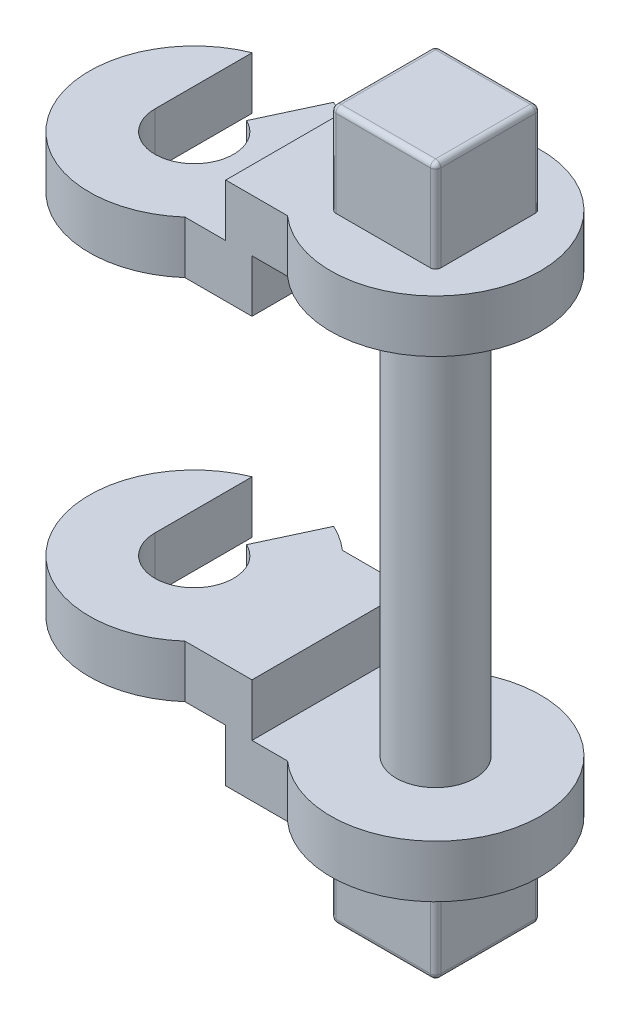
ISO-10303-21;
HEADER;
FILE_DESCRIPTION(('STEP AP214'),'2;1');
FILE_NAME('part.step','',(''),(''),'','','');
FILE_SCHEMA(('AUTOMOTIVE_DESIGN { 1 0 10303 214 1 1 1 1 }'));
ENDSEC;
DATA;
#1=APPLICATION_CONTEXT('core data for automotive mechanical design processes');
#2=APPLICATION_PROTOCOL_DEFINITION('international standard','automotive_design',2000,#1);
#3=PRODUCT_CONTEXT('',#1,'mechanical');
#4=PRODUCT('Part','Part','',(#3));
#5=PRODUCT_RELATED_PRODUCT_CATEGORY('part','',(#4));
#6=PRODUCT_DEFINITION_FORMATION('','',#4);
#7=PRODUCT_DEFINITION_CONTEXT('part definition',#1,'design');
#8=PRODUCT_DEFINITION('design','',#6,#7);
#9=PRODUCT_DEFINITION_SHAPE('','',#8);
#10=(LENGTH_UNIT() NAMED_UNIT(*) SI_UNIT(.MILLI.,.METRE.));
#11=(NAMED_UNIT(*) PLANE_ANGLE_UNIT() SI_UNIT($,.RADIAN.));
#12=(NAMED_UNIT(*) SI_UNIT($,.STERADIAN.) SOLID_ANGLE_UNIT());
#13=UNCERTAINTY_MEASURE_WITH_UNIT(LENGTH_MEASURE(1.E-05),#10,'distance_accuracy_value','');
#14=(GEOMETRIC_REPRESENTATION_CONTEXT(3) GLOBAL_UNCERTAINTY_ASSIGNED_CONTEXT((#13)) GLOBAL_UNIT_ASSIGNED_CONTEXT((#10,
#11,#12)) REPRESENTATION_CONTEXT('',''));
#15=CARTESIAN_POINT('',(0.,0.,0.));
#16=DIRECTION('',(0.,0.,1.));
#17=DIRECTION('',(1.,0.,0.));
#18=AXIS2_PLACEMENT_3D('',#15,#16,#17);
#19=CARTESIAN_POINT('',(-4.6,4.,0.));
#20=DIRECTION('',(0.,-1.,0.));
#21=DIRECTION('',(0.,0.,-1.));
#22=AXIS2_PLACEMENT_3D('',#19,#20,#21);
#23=CYLINDRICAL_SURFACE('',#22,2.);
#24=DIRECTION('',(0.,1.,0.));
#25=VECTOR('',#24,1.);
#26=CARTESIAN_POINT('',(-5.35,-6.75,-1.85404962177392));
#27=LINE('',#26,#25);
#28=CARTESIAN_POINT('',(-5.35,3.,-1.85404962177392));
#29=VERTEX_POINT('',#28);
#30=CARTESIAN_POINT('',(-5.35,4.,-1.85404962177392));
#31=VERTEX_POINT('',#30);
#32=EDGE_CURVE('E468',#29,#31,#27,.T.);
#33=ORIENTED_EDGE('',*,*,#32,.F.);
#34=CARTESIAN_POINT('',(-4.6,3.,0.));
#35=DIRECTION('',(0.,-1.,0.));
#36=DIRECTION('',(0.,0.,-1.));
#37=AXIS2_PLACEMENT_3D('',#34,#35,#36);
#38=CIRCLE('',#37,2.);
#39=CARTESIAN_POINT('',(-3.2771243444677,3.,1.5));
#40=VERTEX_POINT('',#39);
#41=EDGE_CURVE('E354',#40,#29,#38,.T.);
#42=ORIENTED_EDGE('',*,*,#41,.F.);
#43=DIRECTION('',(0.,-1.,0.));
#44=VECTOR('',#43,1.);
#45=CARTESIAN_POINT('',(-3.2771243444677,4.,1.5));
#46=LINE('',#45,#44);
#47=CARTESIAN_POINT('',(-3.2771243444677,4.,1.5));
#48=VERTEX_POINT('',#47);
#49=EDGE_CURVE('E360',#48,#40,#46,.T.);
#50=ORIENTED_EDGE('',*,*,#49,.F.);
#51=CARTESIAN_POINT('',(-4.6,4.,0.));
#52=DIRECTION('',(0.,-1.,0.));
#53=DIRECTION('',(0.,0.,-1.));
#54=AXIS2_PLACEMENT_3D('',#51,#52,#53);
#55=CIRCLE('',#54,2.);
#56=EDGE_CURVE('E343',#48,#31,#55,.T.);
#57=ORIENTED_EDGE('',*,*,#56,.T.);
#58=EDGE_LOOP('',(#33,#42,#50,#57));
#59=FACE_BOUND('',#58,.T.);
#60=ADVANCED_FACE('F34',(#59),#23,.T.);
#61=CARTESIAN_POINT('',(-4.6,-4.,0.));
#62=DIRECTION('',(0.,1.,0.));
#63=DIRECTION('',(0.,0.,1.));
#64=AXIS2_PLACEMENT_3D('',#61,#62,#63);
#65=CYLINDRICAL_SURFACE('',#64,2.);
#66=CARTESIAN_POINT('',(-4.6,-3.,0.));
#67=DIRECTION('',(0.,-1.,0.));
#68=DIRECTION('',(0.,0.,-1.));
#69=AXIS2_PLACEMENT_3D('',#66,#67,#68);
#70=CIRCLE('',#69,2.);
#71=CARTESIAN_POINT('',(-3.2771243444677,-3.,1.5));
#72=VERTEX_POINT('',#71);
#73=CARTESIAN_POINT('',(-5.35,-3.,-1.85404962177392));
#74=VERTEX_POINT('',#73);
#75=EDGE_CURVE('E423',#72,#74,#70,.T.);
#76=ORIENTED_EDGE('',*,*,#75,.T.);
#77=CARTESIAN_POINT('',(-5.35,-4.,-1.85404962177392));
#78=VERTEX_POINT('',#77);
#79=EDGE_CURVE('E472',#78,#74,#27,.T.);
#80=ORIENTED_EDGE('',*,*,#79,.F.);
#81=CARTESIAN_POINT('',(-4.6,-4.,0.));
#82=DIRECTION('',(0.,-1.,0.));
#83=DIRECTION('',(0.,0.,-1.));
#84=AXIS2_PLACEMENT_3D('',#81,#82,#83);
#85=CIRCLE('',#84,2.);
#86=CARTESIAN_POINT('',(-3.2771243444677,-4.,1.5));
#87=VERTEX_POINT('',#86);
#88=EDGE_CURVE('E431',#87,#78,#85,.T.);
#89=ORIENTED_EDGE('',*,*,#88,.F.);
#90=DIRECTION('',(0.,1.,0.));
#91=VECTOR('',#90,1.);
#92=CARTESIAN_POINT('',(-3.2771243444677,-4.,1.5));
#93=LINE('',#92,#91);
#94=EDGE_CURVE('E439',#87,#72,#93,.T.);
#95=ORIENTED_EDGE('',*,*,#94,.T.);
#96=EDGE_LOOP('',(#76,#80,#89,#95));
#97=FACE_BOUND('',#96,.T.);
#98=ADVANCED_FACE('F847',(#97),#65,.T.);
#99=CARTESIAN_POINT('',(-2.5,0.645898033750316,-1.5));
#100=DIRECTION('',(-1.,0.,0.));
#101=DIRECTION('',(0.,0.,1.));
#102=AXIS2_PLACEMENT_3D('',#99,#100,#101);
#103=PLANE('',#102);
#104=DIRECTION('',(0.,1.,0.));
#105=VECTOR('',#104,1.);
#106=CARTESIAN_POINT('',(-2.5,0.645898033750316,-1.5));
#107=LINE('',#106,#105);
#108=CARTESIAN_POINT('',(-2.5,4.,-1.5));
#109=VERTEX_POINT('',#108);
#110=CARTESIAN_POINT('',(-2.5,5.,-1.5));
#111=VERTEX_POINT('',#110);
#112=EDGE_CURVE('E744',#109,#111,#107,.T.);
#113=ORIENTED_EDGE('',*,*,#112,.F.);
#114=DIRECTION('',(0.,0.,1.));
#115=VECTOR('',#114,1.);
#116=CARTESIAN_POINT('',(-2.5,4.,-1.5));
#117=LINE('',#116,#115);
#118=CARTESIAN_POINT('',(-2.5,4.,1.5));
#119=VERTEX_POINT('',#118);
#120=EDGE_CURVE('E348',#109,#119,#117,.T.);
#121=ORIENTED_EDGE('',*,*,#120,.T.);
#122=DIRECTION('',(0.,1.,0.));
#123=VECTOR('',#122,1.);
#124=CARTESIAN_POINT('',(-2.5,0.645898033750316,1.5));
#125=LINE('',#124,#123);
#126=CARTESIAN_POINT('',(-2.5,5.,1.5));
#127=VERTEX_POINT('',#126);
#128=EDGE_CURVE('E747',#119,#127,#125,.T.);
#129=ORIENTED_EDGE('',*,*,#128,.T.);
#130=DIRECTION('',(0.,0.,1.));
#131=VECTOR('',#130,1.);
#132=CARTESIAN_POINT('',(-2.5,5.,-1.5));
#133=LINE('',#132,#131);
#134=EDGE_CURVE('E1462',#111,#127,#133,.T.);
#135=ORIENTED_EDGE('',*,*,#134,.F.);
#136=EDGE_LOOP('',(#113,#121,#129,#135));
#137=FACE_BOUND('',#136,.T.);
#138=ADVANCED_FACE('F852',(#137),#103,.T.);
#139=CARTESIAN_POINT('',(0.,4.,0.));
#140=DIRECTION('',(0.,1.,0.));
#141=DIRECTION('',(0.,0.,1.));
#142=AXIS2_PLACEMENT_3D('',#139,#140,#141);
#143=PLANE('',#142);
#144=CARTESIAN_POINT('',(0.,4.,0.));
#145=DIRECTION('',(0.,1.,0.));
#146=DIRECTION('',(0.,0.,1.));
#147=AXIS2_PLACEMENT_3D('',#144,#145,#146);
#148=CIRCLE('',#147,0.750000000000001);
#149=CARTESIAN_POINT('',(0.,4.,0.750000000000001));
#150=VERTEX_POINT('',#149);
#151=EDGE_CURVE('E522',#150,#150,#148,.T.);
#152=ORIENTED_EDGE('',*,*,#151,.T.);
#153=EDGE_LOOP('',(#152));
#154=FACE_BOUND('',#153,.T.);
#155=DIRECTION('',(0.,0.,1.));
#156=VECTOR('',#155,1.);
#157=CARTESIAN_POINT('',(-2.,4.,0.));
#158=LINE('',#157,#156);
#159=CARTESIAN_POINT('',(-2.,4.,-1.5));
#160=VERTEX_POINT('',#159);
#161=CARTESIAN_POINT('',(-2.,4.,1.5));
#162=VERTEX_POINT('',#161);
#163=EDGE_CURVE('E388',#160,#162,#158,.T.);
#164=ORIENTED_EDGE('',*,*,#163,.F.);
#165=DIRECTION('',(1.,0.,0.));
#166=VECTOR('',#165,1.);
#167=CARTESIAN_POINT('',(-1.,4.,-1.5));
#168=LINE('',#167,#166);
#169=CARTESIAN_POINT('',(-1.3228756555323,4.,-1.5));
#170=VERTEX_POINT('',#169);
#171=EDGE_CURVE('E457',#160,#170,#168,.T.);
#172=ORIENTED_EDGE('',*,*,#171,.T.);
#173=CARTESIAN_POINT('',(0.,4.,0.));
#174=DIRECTION('',(0.,1.,0.));
#175=DIRECTION('',(0.,0.,1.));
#176=AXIS2_PLACEMENT_3D('',#173,#174,#175);
#177=CIRCLE('',#176,2.);
#178=CARTESIAN_POINT('',(-1.3228756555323,4.,1.5));
#179=VERTEX_POINT('',#178);
#180=EDGE_CURVE('E739',#179,#170,#177,.T.);
#181=ORIENTED_EDGE('',*,*,#180,.F.);
#182=DIRECTION('',(-1.,0.,0.));
#183=VECTOR('',#182,1.);
#184=CARTESIAN_POINT('',(-1.,4.,1.5));
#185=LINE('',#184,#183);
#186=EDGE_CURVE('E757',#179,#162,#185,.T.);
#187=ORIENTED_EDGE('',*,*,#186,.T.);
#188=EDGE_LOOP('',(#164,#172,#181,#187));
#189=FACE_BOUND('',#188,.T.);
#190=ADVANCED_FACE('F886',(#154,#189),#143,.F.);
#191=CARTESIAN_POINT('',(0.,-5.,0.));
#192=DIRECTION('',(0.,-1.,0.));
#193=DIRECTION('',(0.,0.,-1.));
#194=AXIS2_PLACEMENT_3D('',#191,#192,#193);
#195=PLANE('',#194);
#196=DIRECTION('',(-1.,0.,0.));
#197=VECTOR('',#196,1.);
#198=CARTESIAN_POINT('',(-1.,-5.,1.5));
#199=LINE('',#198,#197);
#200=CARTESIAN_POINT('',(-1.3228756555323,-5.,1.5));
#201=VERTEX_POINT('',#200);
#202=CARTESIAN_POINT('',(-2.5,-5.,1.5));
#203=VERTEX_POINT('',#202);
#204=EDGE_CURVE('E393',#201,#203,#199,.T.);
#205=ORIENTED_EDGE('',*,*,#204,.T.);
#206=DIRECTION('',(0.,0.,-1.));
#207=VECTOR('',#206,1.);
#208=CARTESIAN_POINT('',(-2.5,-5.,-1.5));
#209=LINE('',#208,#207);
#210=CARTESIAN_POINT('',(-2.5,-5.,-1.5));
#211=VERTEX_POINT('',#210);
#212=EDGE_CURVE('E400',#203,#211,#209,.T.);
#213=ORIENTED_EDGE('',*,*,#212,.T.);
#214=DIRECTION('',(1.,0.,0.));
#215=VECTOR('',#214,1.);
#216=CARTESIAN_POINT('',(-1.,-5.,-1.5));
#217=LINE('',#216,#215);
#218=CARTESIAN_POINT('',(-1.3228756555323,-5.,-1.5));
#219=VERTEX_POINT('',#218);
#220=EDGE_CURVE('E403',#211,#219,#217,.T.);
#221=ORIENTED_EDGE('',*,*,#220,.T.);
#222=CARTESIAN_POINT('',(0.,-5.,0.));
#223=DIRECTION('',(0.,-1.,0.));
#224=DIRECTION('',(0.,0.,-1.));
#225=AXIS2_PLACEMENT_3D('',#222,#223,#224);
#226=CIRCLE('',#225,2.);
#227=EDGE_CURVE('E731',#219,#201,#226,.T.);
#228=ORIENTED_EDGE('',*,*,#227,.T.);
#229=EDGE_LOOP('',(#205,#213,#221,#228));
#230=FACE_BOUND('',#229,.T.);
#231=DIRECTION('',(1.,0.,0.));
#232=VECTOR('',#231,1.);
#233=CARTESIAN_POINT('',(-1.,-5.,-1.));
#234=LINE('',#233,#232);
#235=CARTESIAN_POINT('',(-0.9,-5.,-1.));
#236=VERTEX_POINT('',#235);
#237=CARTESIAN_POINT('',(0.9,-5.,-1.));
#238=VERTEX_POINT('',#237);
#239=EDGE_CURVE('E765',#236,#238,#234,.T.);
#240=ORIENTED_EDGE('',*,*,#239,.F.);
#241=CARTESIAN_POINT('',(-0.9,-5.,-0.9));
#242=DIRECTION('',(0.,-1.,0.));
#243=DIRECTION('',(0.,0.,-1.));
#244=AXIS2_PLACEMENT_3D('',#241,#242,#243);
#245=CIRCLE('',#244,0.1);
#246=CARTESIAN_POINT('',(-1.,-5.,-0.9));
#247=VERTEX_POINT('',#246);
#248=EDGE_CURVE('E604',#236,#247,#245,.F.);
#249=ORIENTED_EDGE('',*,*,#248,.T.);
#250=DIRECTION('',(0.,0.,-1.));
#251=VECTOR('',#250,1.);
#252=CARTESIAN_POINT('',(-1.,-5.,-1.));
#253=LINE('',#252,#251);
#254=CARTESIAN_POINT('',(-1.,-5.,0.9));
#255=VERTEX_POINT('',#254);
#256=EDGE_CURVE('E762',#255,#247,#253,.T.);
#257=ORIENTED_EDGE('',*,*,#256,.F.);
#258=CARTESIAN_POINT('',(-0.9,-5.,0.9));
#259=DIRECTION('',(0.,-1.,0.));
#260=DIRECTION('',(0.,0.,-1.));
#261=AXIS2_PLACEMENT_3D('',#258,#259,#260);
#262=CIRCLE('',#261,0.1);
#263=CARTESIAN_POINT('',(-0.9,-5.,1.));
#264=VERTEX_POINT('',#263);
#265=EDGE_CURVE('E602',#255,#264,#262,.F.);
#266=ORIENTED_EDGE('',*,*,#265,.T.);
#267=DIRECTION('',(-1.,0.,0.));
#268=VECTOR('',#267,1.);
#269=CARTESIAN_POINT('',(-1.,-5.,1.));
#270=LINE('',#269,#268);
#271=CARTESIAN_POINT('',(0.9,-5.,1.));
#272=VERTEX_POINT('',#271);
#273=EDGE_CURVE('E716',#272,#264,#270,.T.);
#274=ORIENTED_EDGE('',*,*,#273,.F.);
#275=CARTESIAN_POINT('',(0.9,-5.,0.9));
#276=DIRECTION('',(0.,-1.,0.));
#277=DIRECTION('',(0.,0.,-1.));
#278=AXIS2_PLACEMENT_3D('',#275,#276,#277);
#279=CIRCLE('',#278,0.1);
#280=CARTESIAN_POINT('',(1.,-5.,0.9));
#281=VERTEX_POINT('',#280);
#282=EDGE_CURVE('E598',#272,#281,#279,.F.);
#283=ORIENTED_EDGE('',*,*,#282,.T.);
#284=DIRECTION('',(0.,0.,1.));
#285=VECTOR('',#284,1.);
#286=CARTESIAN_POINT('',(1.,-5.,-1.));
#287=LINE('',#286,#285);
#288=CARTESIAN_POINT('',(1.,-5.,-0.9));
#289=VERTEX_POINT('',#288);
#290=EDGE_CURVE('E721',#289,#281,#287,.T.);
#291=ORIENTED_EDGE('',*,*,#290,.F.);
#292=CARTESIAN_POINT('',(0.9,-5.,-0.9));
#293=DIRECTION('',(0.,-1.,0.));
#294=DIRECTION('',(0.,0.,-1.));
#295=AXIS2_PLACEMENT_3D('',#292,#293,#294);
#296=CIRCLE('',#295,0.1);
#297=EDGE_CURVE('E600',#289,#238,#296,.F.);
#298=ORIENTED_EDGE('',*,*,#297,.T.);
#299=EDGE_LOOP('',(#240,#249,#257,#266,#274,#283,#291,#298));
#300=FACE_BOUND('',#299,.T.);
#301=ADVANCED_FACE('F813',(#230,#300),#195,.T.);
#302=CARTESIAN_POINT('',(0.,5.,0.));
#303=DIRECTION('',(0.,1.,0.));
#304=DIRECTION('',(0.,0.,1.));
#305=AXIS2_PLACEMENT_3D('',#302,#303,#304);
#306=PLANE('',#305);
#307=DIRECTION('',(1.,0.,0.));
#308=VECTOR('',#307,1.);
#309=CARTESIAN_POINT('',(-1.,5.,1.5));
#310=LINE('',#309,#308);
#311=CARTESIAN_POINT('',(-1.3228756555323,5.,1.5));
#312=VERTEX_POINT('',#311);
#313=EDGE_CURVE('E748',#127,#312,#310,.T.);
#314=ORIENTED_EDGE('',*,*,#313,.T.);
#315=CARTESIAN_POINT('',(0.,5.,0.));
#316=DIRECTION('',(0.,1.,0.));
#317=DIRECTION('',(0.,0.,1.));
#318=AXIS2_PLACEMENT_3D('',#315,#316,#317);
#319=CIRCLE('',#318,2.);
#320=CARTESIAN_POINT('',(-1.3228756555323,5.,-1.5));
#321=VERTEX_POINT('',#320);
#322=EDGE_CURVE('E527',#312,#321,#319,.T.);
#323=ORIENTED_EDGE('',*,*,#322,.T.);
#324=DIRECTION('',(-1.,0.,0.));
#325=VECTOR('',#324,1.);
#326=CARTESIAN_POINT('',(-1.,5.,-1.5));
#327=LINE('',#326,#325);
#328=EDGE_CURVE('E1459',#321,#111,#327,.T.);
#329=ORIENTED_EDGE('',*,*,#328,.T.);
#330=ORIENTED_EDGE('',*,*,#134,.T.);
#331=EDGE_LOOP('',(#314,#323,#329,#330));
#332=FACE_BOUND('',#331,.T.);
#333=DIRECTION('',(1.,0.,0.));
#334=VECTOR('',#333,1.);
#335=CARTESIAN_POINT('',(1.,5.,1.));
#336=LINE('',#335,#334);
#337=CARTESIAN_POINT('',(-0.9,5.,1.));
#338=VERTEX_POINT('',#337);
#339=CARTESIAN_POINT('',(0.9,5.,1.));
#340=VERTEX_POINT('',#339);
#341=EDGE_CURVE('E727',#338,#340,#336,.T.);
#342=ORIENTED_EDGE('',*,*,#341,.F.);
#343=CARTESIAN_POINT('',(-0.9,5.,0.9));
#344=DIRECTION('',(0.,1.,0.));
#345=DIRECTION('',(0.,0.,1.));
#346=AXIS2_PLACEMENT_3D('',#343,#344,#345);
#347=CIRCLE('',#346,0.1);
#348=CARTESIAN_POINT('',(-1.,5.,0.9));
#349=VERTEX_POINT('',#348);
#350=EDGE_CURVE('E43',#338,#349,#347,.F.);
#351=ORIENTED_EDGE('',*,*,#350,.T.);
#352=DIRECTION('',(0.,0.,1.));
#353=VECTOR('',#352,1.);
#354=CARTESIAN_POINT('',(-1.,5.,-1.));
#355=LINE('',#354,#353);
#356=CARTESIAN_POINT('',(-1.,5.,-0.9));
#357=VERTEX_POINT('',#356);
#358=EDGE_CURVE('E718',#357,#349,#355,.T.);
#359=ORIENTED_EDGE('',*,*,#358,.F.);
#360=CARTESIAN_POINT('',(-0.9,5.,-0.9));
#361=DIRECTION('',(0.,1.,0.));
#362=DIRECTION('',(0.,0.,1.));
#363=AXIS2_PLACEMENT_3D('',#360,#361,#362);
#364=CIRCLE('',#363,0.1);
#365=CARTESIAN_POINT('',(-0.9,5.,-1.));
#366=VERTEX_POINT('',#365);
#367=EDGE_CURVE('E606',#357,#366,#364,.F.);
#368=ORIENTED_EDGE('',*,*,#367,.T.);
#369=DIRECTION('',(-1.,0.,0.));
#370=VECTOR('',#369,1.);
#371=CARTESIAN_POINT('',(1.,5.,-1.));
#372=LINE('',#371,#370);
#373=CARTESIAN_POINT('',(0.9,5.,-1.));
#374=VERTEX_POINT('',#373);
#375=EDGE_CURVE('E714',#374,#366,#372,.T.);
#376=ORIENTED_EDGE('',*,*,#375,.F.);
#377=CARTESIAN_POINT('',(0.9,5.,-0.9));
#378=DIRECTION('',(0.,1.,0.));
#379=DIRECTION('',(0.,0.,1.));
#380=AXIS2_PLACEMENT_3D('',#377,#378,#379);
#381=CIRCLE('',#380,0.1);
#382=CARTESIAN_POINT('',(1.,5.,-0.9));
#383=VERTEX_POINT('',#382);
#384=EDGE_CURVE('E608',#374,#383,#381,.F.);
#385=ORIENTED_EDGE('',*,*,#384,.T.);
#386=DIRECTION('',(0.,0.,-1.));
#387=VECTOR('',#386,1.);
#388=CARTESIAN_POINT('',(1.,5.,-1.));
#389=LINE('',#388,#387);
#390=CARTESIAN_POINT('',(1.,5.,0.9));
#391=VERTEX_POINT('',#390);
#392=EDGE_CURVE('E712',#391,#383,#389,.T.);
#393=ORIENTED_EDGE('',*,*,#392,.F.);
#394=CARTESIAN_POINT('',(0.9,5.,0.9));
#395=DIRECTION('',(0.,1.,0.));
#396=DIRECTION('',(0.,0.,1.));
#397=AXIS2_PLACEMENT_3D('',#394,#395,#396);
#398=CIRCLE('',#397,0.1);
#399=EDGE_CURVE('E11',#391,#340,#398,.F.);
#400=ORIENTED_EDGE('',*,*,#399,.T.);
#401=EDGE_LOOP('',(#342,#351,#359,#368,#376,#385,#393,#400));
#402=FACE_BOUND('',#401,.T.);
#403=ADVANCED_FACE('F711',(#332,#402),#306,.T.);
#404=CARTESIAN_POINT('',(0.,-4.,0.));
#405=DIRECTION('',(0.,1.,0.));
#406=DIRECTION('',(0.,0.,1.));
#407=AXIS2_PLACEMENT_3D('',#404,#405,#406);
#408=CYLINDRICAL_SURFACE('',#407,0.750000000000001);
#409=CARTESIAN_POINT('',(0.,-4.,0.));
#410=DIRECTION('',(0.,-1.,0.));
#411=DIRECTION('',(0.,0.,-1.));
#412=AXIS2_PLACEMENT_3D('',#409,#410,#411);
#413=CIRCLE('',#412,0.750000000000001);
#414=CARTESIAN_POINT('',(0.,-4.,-0.750000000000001));
#415=VERTEX_POINT('',#414);
#416=EDGE_CURVE('E734',#415,#415,#413,.F.);
#417=ORIENTED_EDGE('',*,*,#416,.T.);
#418=EDGE_LOOP('',(#417));
#419=FACE_BOUND('',#418,.T.);
#420=ORIENTED_EDGE('',*,*,#151,.F.);
#421=EDGE_LOOP('',(#420));
#422=FACE_BOUND('',#421,.T.);
#423=ADVANCED_FACE('F1263',(#419,#422),#408,.T.);
#424=CARTESIAN_POINT('',(0.,5.,0.));
#425=DIRECTION('',(0.,-1.,0.));
#426=DIRECTION('',(0.,0.,-1.));
#427=AXIS2_PLACEMENT_3D('',#424,#425,#426);
#428=CYLINDRICAL_SURFACE('',#427,2.);
#429=ORIENTED_EDGE('',*,*,#322,.F.);
#430=DIRECTION('',(0.,-1.,0.));
#431=VECTOR('',#430,1.);
#432=CARTESIAN_POINT('',(-1.3228756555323,5.,1.5));
#433=LINE('',#432,#431);
#434=EDGE_CURVE('E759',#312,#179,#433,.T.);
#435=ORIENTED_EDGE('',*,*,#434,.T.);
#436=ORIENTED_EDGE('',*,*,#180,.T.);
#437=DIRECTION('',(0.,-1.,0.));
#438=VECTOR('',#437,1.);
#439=CARTESIAN_POINT('',(-1.3228756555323,5.,-1.5));
#440=LINE('',#439,#438);
#441=EDGE_CURVE('E756',#170,#321,#440,.F.);
#442=ORIENTED_EDGE('',*,*,#441,.T.);
#443=EDGE_LOOP('',(#429,#435,#436,#442));
#444=FACE_BOUND('',#443,.T.);
#445=ADVANCED_FACE('F1266',(#444),#428,.T.);
#446=CARTESIAN_POINT('',(0.,-5.,0.));
#447=DIRECTION('',(0.,1.,0.));
#448=DIRECTION('',(0.,0.,1.));
#449=AXIS2_PLACEMENT_3D('',#446,#447,#448);
#450=CYLINDRICAL_SURFACE('',#449,2.);
#451=ORIENTED_EDGE('',*,*,#227,.F.);
#452=DIRECTION('',(0.,1.,0.));
#453=VECTOR('',#452,1.);
#454=CARTESIAN_POINT('',(-1.3228756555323,-5.,-1.5));
#455=LINE('',#454,#453);
#456=CARTESIAN_POINT('',(-1.3228756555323,-4.,-1.5));
#457=VERTEX_POINT('',#456);
#458=EDGE_CURVE('E1457',#219,#457,#455,.T.);
#459=ORIENTED_EDGE('',*,*,#458,.T.);
#460=CARTESIAN_POINT('',(0.,-4.,0.));
#461=DIRECTION('',(0.,-1.,0.));
#462=DIRECTION('',(0.,0.,-1.));
#463=AXIS2_PLACEMENT_3D('',#460,#461,#462);
#464=CIRCLE('',#463,2.);
#465=CARTESIAN_POINT('',(-1.3228756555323,-4.,1.5));
#466=VERTEX_POINT('',#465);
#467=EDGE_CURVE('E730',#457,#466,#464,.T.);
#468=ORIENTED_EDGE('',*,*,#467,.T.);
#469=DIRECTION('',(0.,1.,0.));
#470=VECTOR('',#469,1.);
#471=CARTESIAN_POINT('',(-1.3228756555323,-5.,1.5));
#472=LINE('',#471,#470);
#473=EDGE_CURVE('E1470',#466,#201,#472,.F.);
#474=ORIENTED_EDGE('',*,*,#473,.T.);
#475=EDGE_LOOP('',(#451,#459,#468,#474));
#476=FACE_BOUND('',#475,.T.);
#477=ADVANCED_FACE('F1270',(#476),#450,.T.);
#478=CARTESIAN_POINT('',(0.,-4.,0.));
#479=DIRECTION('',(0.,-1.,0.));
#480=DIRECTION('',(0.,0.,-1.));
#481=AXIS2_PLACEMENT_3D('',#478,#479,#480);
#482=PLANE('',#481);
#483=ORIENTED_EDGE('',*,*,#416,.F.);
#484=EDGE_LOOP('',(#483));
#485=FACE_BOUND('',#484,.T.);
#486=DIRECTION('',(-1.,0.,0.));
#487=VECTOR('',#486,1.);
#488=CARTESIAN_POINT('',(-1.,-4.,-1.5));
#489=LINE('',#488,#487);
#490=CARTESIAN_POINT('',(-2.,-4.,-1.5));
#491=VERTEX_POINT('',#490);
#492=EDGE_CURVE('E394',#457,#491,#489,.T.);
#493=ORIENTED_EDGE('',*,*,#492,.T.);
#494=DIRECTION('',(0.,0.,1.));
#495=VECTOR('',#494,1.);
#496=CARTESIAN_POINT('',(-2.,-4.,0.));
#497=LINE('',#496,#495);
#498=CARTESIAN_POINT('',(-2.,-4.,1.5));
#499=VERTEX_POINT('',#498);
#500=EDGE_CURVE('E374',#491,#499,#497,.T.);
#501=ORIENTED_EDGE('',*,*,#500,.T.);
#502=DIRECTION('',(1.,0.,0.));
#503=VECTOR('',#502,1.);
#504=CARTESIAN_POINT('',(-1.,-4.,1.5));
#505=LINE('',#504,#503);
#506=EDGE_CURVE('E396',#499,#466,#505,.T.);
#507=ORIENTED_EDGE('',*,*,#506,.T.);
#508=ORIENTED_EDGE('',*,*,#467,.F.);
#509=EDGE_LOOP('',(#493,#501,#507,#508));
#510=FACE_BOUND('',#509,.T.);
#511=ADVANCED_FACE('F1279',(#485,#510),#482,.F.);
#512=CARTESIAN_POINT('',(1.,6.75,-1.));
#513=DIRECTION('',(-1.,0.,0.));
#514=DIRECTION('',(0.,0.,1.));
#515=AXIS2_PLACEMENT_3D('',#512,#513,#514);
#516=PLANE('',#515);
#517=ORIENTED_EDGE('',*,*,#392,.T.);
#518=DIRECTION('',(0.,-1.,0.));
#519=VECTOR('',#518,1.);
#520=CARTESIAN_POINT('',(1.,6.75,-0.9));
#521=LINE('',#520,#519);
#522=CARTESIAN_POINT('',(1.,6.65,-0.9));
#523=VERTEX_POINT('',#522);
#524=EDGE_CURVE('E51',#383,#523,#521,.F.);
#525=ORIENTED_EDGE('',*,*,#524,.T.);
#526=DIRECTION('',(0.,0.,-1.));
#527=VECTOR('',#526,1.);
#528=CARTESIAN_POINT('',(1.,6.65,-1.));
#529=LINE('',#528,#527);
#530=CARTESIAN_POINT('',(1.,6.65,0.9));
#531=VERTEX_POINT('',#530);
#532=EDGE_CURVE('E56',#523,#531,#529,.F.);
#533=ORIENTED_EDGE('',*,*,#532,.T.);
#534=DIRECTION('',(0.,-1.,0.));
#535=VECTOR('',#534,1.);
#536=CARTESIAN_POINT('',(1.,6.75,0.9));
#537=LINE('',#536,#535);
#538=EDGE_CURVE('E594',#531,#391,#537,.T.);
#539=ORIENTED_EDGE('',*,*,#538,.T.);
#540=EDGE_LOOP('',(#517,#525,#533,#539));
#541=FACE_BOUND('',#540,.T.);
#542=ADVANCED_FACE('F715',(#541),#516,.F.);
#543=CARTESIAN_POINT('',(1.,6.75,-1.));
#544=DIRECTION('',(0.,0.,1.));
#545=DIRECTION('',(1.,0.,0.));
#546=AXIS2_PLACEMENT_3D('',#543,#544,#545);
#547=PLANE('',#546);
#548=ORIENTED_EDGE('',*,*,#375,.T.);
#549=DIRECTION('',(0.,-1.,0.));
#550=VECTOR('',#549,1.);
#551=CARTESIAN_POINT('',(-0.9,6.75,-1.));
#552=LINE('',#551,#550);
#553=CARTESIAN_POINT('',(-0.9,6.65,-1.));
#554=VERTEX_POINT('',#553);
#555=EDGE_CURVE('E592',#366,#554,#552,.F.);
#556=ORIENTED_EDGE('',*,*,#555,.T.);
#557=DIRECTION('',(-1.,0.,0.));
#558=VECTOR('',#557,1.);
#559=CARTESIAN_POINT('',(1.,6.65,-1.));
#560=LINE('',#559,#558);
#561=CARTESIAN_POINT('',(0.9,6.65,-1.));
#562=VERTEX_POINT('',#561);
#563=EDGE_CURVE('E590',#554,#562,#560,.F.);
#564=ORIENTED_EDGE('',*,*,#563,.T.);
#565=DIRECTION('',(0.,-1.,0.));
#566=VECTOR('',#565,1.);
#567=CARTESIAN_POINT('',(0.9,6.75,-1.));
#568=LINE('',#567,#566);
#569=EDGE_CURVE('E588',#562,#374,#568,.T.);
#570=ORIENTED_EDGE('',*,*,#569,.T.);
#571=EDGE_LOOP('',(#548,#556,#564,#570));
#572=FACE_BOUND('',#571,.T.);
#573=ADVANCED_FACE('F702',(#572),#547,.F.);
#574=CARTESIAN_POINT('',(-1.,6.75,-1.));
#575=DIRECTION('',(1.,0.,0.));
#576=DIRECTION('',(0.,0.,-1.));
#577=AXIS2_PLACEMENT_3D('',#574,#575,#576);
#578=PLANE('',#577);
#579=DIRECTION('',(0.,0.,1.));
#580=VECTOR('',#579,1.);
#581=CARTESIAN_POINT('',(-1.,6.65,-1.));
#582=LINE('',#581,#580);
#583=CARTESIAN_POINT('',(-1.,6.65,0.9));
#584=VERTEX_POINT('',#583);
#585=CARTESIAN_POINT('',(-1.,6.65,-0.9));
#586=VERTEX_POINT('',#585);
#587=EDGE_CURVE('E584',#584,#586,#582,.F.);
#588=ORIENTED_EDGE('',*,*,#587,.T.);
#589=DIRECTION('',(0.,-1.,0.));
#590=VECTOR('',#589,1.);
#591=CARTESIAN_POINT('',(-1.,6.75,-0.9));
#592=LINE('',#591,#590);
#593=EDGE_CURVE('E586',#586,#357,#592,.T.);
#594=ORIENTED_EDGE('',*,*,#593,.T.);
#595=ORIENTED_EDGE('',*,*,#358,.T.);
#596=DIRECTION('',(0.,-1.,0.));
#597=VECTOR('',#596,1.);
#598=CARTESIAN_POINT('',(-1.,6.75,0.9));
#599=LINE('',#598,#597);
#600=EDGE_CURVE('E582',#349,#584,#599,.F.);
#601=ORIENTED_EDGE('',*,*,#600,.T.);
#602=EDGE_LOOP('',(#588,#594,#595,#601));
#603=FACE_BOUND('',#602,.T.);
#604=ADVANCED_FACE('F1291',(#603),#578,.F.);
#605=CARTESIAN_POINT('',(1.,6.75,1.));
#606=DIRECTION('',(0.,0.,-1.));
#607=DIRECTION('',(-1.,0.,0.));
#608=AXIS2_PLACEMENT_3D('',#605,#606,#607);
#609=PLANE('',#608);
#610=DIRECTION('',(1.,0.,0.));
#611=VECTOR('',#610,1.);
#612=CARTESIAN_POINT('',(1.,6.65,1.));
#613=LINE('',#612,#611);
#614=CARTESIAN_POINT('',(0.9,6.65,1.));
#615=VERTEX_POINT('',#614);
#616=CARTESIAN_POINT('',(-0.9,6.65,1.));
#617=VERTEX_POINT('',#616);
#618=EDGE_CURVE('E577',#615,#617,#613,.F.);
#619=ORIENTED_EDGE('',*,*,#618,.T.);
#620=DIRECTION('',(0.,-1.,0.));
#621=VECTOR('',#620,1.);
#622=CARTESIAN_POINT('',(-0.9,6.75,1.));
#623=LINE('',#622,#621);
#624=EDGE_CURVE('E580',#617,#338,#623,.T.);
#625=ORIENTED_EDGE('',*,*,#624,.T.);
#626=ORIENTED_EDGE('',*,*,#341,.T.);
#627=DIRECTION('',(0.,-1.,0.));
#628=VECTOR('',#627,1.);
#629=CARTESIAN_POINT('',(0.9,6.75,1.));
#630=LINE('',#629,#628);
#631=EDGE_CURVE('E575',#340,#615,#630,.F.);
#632=ORIENTED_EDGE('',*,*,#631,.T.);
#633=EDGE_LOOP('',(#619,#625,#626,#632));
#634=FACE_BOUND('',#633,.T.);
#635=ADVANCED_FACE('F1294',(#634),#609,.F.);
#636=CARTESIAN_POINT('',(1.,6.75,1.));
#637=DIRECTION('',(0.,-1.,0.));
#638=DIRECTION('',(0.,0.,-1.));
#639=AXIS2_PLACEMENT_3D('',#636,#637,#638);
#640=PLANE('',#639);
#641=DIRECTION('',(0.,0.,1.));
#642=VECTOR('',#641,1.);
#643=CARTESIAN_POINT('',(-0.9,6.75,1.));
#644=LINE('',#643,#642);
#645=CARTESIAN_POINT('',(-0.9,6.75,-0.9));
#646=VERTEX_POINT('',#645);
#647=CARTESIAN_POINT('',(-0.9,6.75,0.9));
#648=VERTEX_POINT('',#647);
#649=EDGE_CURVE('E570',#646,#648,#644,.T.);
#650=ORIENTED_EDGE('',*,*,#649,.T.);
#651=DIRECTION('',(1.,0.,0.));
#652=VECTOR('',#651,1.);
#653=CARTESIAN_POINT('',(1.,6.75,0.9));
#654=LINE('',#653,#652);
#655=CARTESIAN_POINT('',(0.9,6.75,0.9));
#656=VERTEX_POINT('',#655);
#657=EDGE_CURVE('E572',#648,#656,#654,.T.);
#658=ORIENTED_EDGE('',*,*,#657,.T.);
#659=DIRECTION('',(0.,0.,-1.));
#660=VECTOR('',#659,1.);
#661=CARTESIAN_POINT('',(0.9,6.75,1.));
#662=LINE('',#661,#660);
#663=CARTESIAN_POINT('',(0.9,6.75,-0.9));
#664=VERTEX_POINT('',#663);
#665=EDGE_CURVE('E566',#656,#664,#662,.T.);
#666=ORIENTED_EDGE('',*,*,#665,.T.);
#667=DIRECTION('',(-1.,0.,0.));
#668=VECTOR('',#667,1.);
#669=CARTESIAN_POINT('',(1.,6.75,-0.9));
#670=LINE('',#669,#668);
#671=EDGE_CURVE('E568',#664,#646,#670,.T.);
#672=ORIENTED_EDGE('',*,*,#671,.T.);
#673=EDGE_LOOP('',(#650,#658,#666,#672));
#674=FACE_BOUND('',#673,.T.);
#675=ADVANCED_FACE('F691',(#674),#640,.F.);
#676=CARTESIAN_POINT('',(-1.,-6.75,-1.));
#677=DIRECTION('',(1.,0.,0.));
#678=DIRECTION('',(0.,0.,-1.));
#679=AXIS2_PLACEMENT_3D('',#676,#677,#678);
#680=PLANE('',#679);
#681=DIRECTION('',(0.,0.,-1.));
#682=VECTOR('',#681,1.);
#683=CARTESIAN_POINT('',(-1.,-6.65,-1.));
#684=LINE('',#683,#682);
#685=CARTESIAN_POINT('',(-1.,-6.65,-0.9));
#686=VERTEX_POINT('',#685);
#687=CARTESIAN_POINT('',(-1.,-6.65,0.9));
#688=VERTEX_POINT('',#687);
#689=EDGE_CURVE('E562',#686,#688,#684,.F.);
#690=ORIENTED_EDGE('',*,*,#689,.T.);
#691=DIRECTION('',(0.,1.,0.));
#692=VECTOR('',#691,1.);
#693=CARTESIAN_POINT('',(-1.,-6.75,0.9));
#694=LINE('',#693,#692);
#695=EDGE_CURVE('E564',#688,#255,#694,.T.);
#696=ORIENTED_EDGE('',*,*,#695,.T.);
#697=ORIENTED_EDGE('',*,*,#256,.T.);
#698=DIRECTION('',(0.,1.,0.));
#699=VECTOR('',#698,1.);
#700=CARTESIAN_POINT('',(-1.,-6.75,-0.9));
#701=LINE('',#700,#699);
#702=EDGE_CURVE('E560',#247,#686,#701,.F.);
#703=ORIENTED_EDGE('',*,*,#702,.T.);
#704=EDGE_LOOP('',(#690,#696,#697,#703));
#705=FACE_BOUND('',#704,.T.);
#706=ADVANCED_FACE('F816',(#705),#680,.F.);
#707=CARTESIAN_POINT('',(-1.,-6.75,-1.));
#708=DIRECTION('',(0.,0.,1.));
#709=DIRECTION('',(1.,0.,0.));
#710=AXIS2_PLACEMENT_3D('',#707,#708,#709);
#711=PLANE('',#710);
#712=ORIENTED_EDGE('',*,*,#239,.T.);
#713=DIRECTION('',(0.,1.,0.));
#714=VECTOR('',#713,1.);
#715=CARTESIAN_POINT('',(0.9,-6.75,-1.));
#716=LINE('',#715,#714);
#717=CARTESIAN_POINT('',(0.9,-6.65,-1.));
#718=VERTEX_POINT('',#717);
#719=EDGE_CURVE('E558',#238,#718,#716,.F.);
#720=ORIENTED_EDGE('',*,*,#719,.T.);
#721=DIRECTION('',(1.,0.,0.));
#722=VECTOR('',#721,1.);
#723=CARTESIAN_POINT('',(-1.,-6.65,-1.));
#724=LINE('',#723,#722);
#725=CARTESIAN_POINT('',(-0.9,-6.65,-1.));
#726=VERTEX_POINT('',#725);
#727=EDGE_CURVE('E556',#718,#726,#724,.F.);
#728=ORIENTED_EDGE('',*,*,#727,.T.);
#729=DIRECTION('',(0.,1.,0.));
#730=VECTOR('',#729,1.);
#731=CARTESIAN_POINT('',(-0.9,-6.75,-1.));
#732=LINE('',#731,#730);
#733=EDGE_CURVE('E554',#726,#236,#732,.T.);
#734=ORIENTED_EDGE('',*,*,#733,.T.);
#735=EDGE_LOOP('',(#712,#720,#728,#734));
#736=FACE_BOUND('',#735,.T.);
#737=ADVANCED_FACE('F804',(#736),#711,.F.);
#738=CARTESIAN_POINT('',(1.,-6.75,-1.));
#739=DIRECTION('',(-1.,0.,0.));
#740=DIRECTION('',(0.,0.,1.));
#741=AXIS2_PLACEMENT_3D('',#738,#739,#740);
#742=PLANE('',#741);
#743=ORIENTED_EDGE('',*,*,#290,.T.);
#744=DIRECTION('',(0.,1.,0.));
#745=VECTOR('',#744,1.);
#746=CARTESIAN_POINT('',(1.,-6.75,0.9));
#747=LINE('',#746,#745);
#748=CARTESIAN_POINT('',(1.,-6.65,0.9));
#749=VERTEX_POINT('',#748);
#750=EDGE_CURVE('E552',#281,#749,#747,.F.);
#751=ORIENTED_EDGE('',*,*,#750,.T.);
#752=DIRECTION('',(0.,0.,1.));
#753=VECTOR('',#752,1.);
#754=CARTESIAN_POINT('',(1.,-6.65,-1.));
#755=LINE('',#754,#753);
#756=CARTESIAN_POINT('',(1.,-6.65,-0.9));
#757=VERTEX_POINT('',#756);
#758=EDGE_CURVE('E550',#749,#757,#755,.F.);
#759=ORIENTED_EDGE('',*,*,#758,.T.);
#760=DIRECTION('',(0.,1.,0.));
#761=VECTOR('',#760,1.);
#762=CARTESIAN_POINT('',(1.,-6.75,-0.9));
#763=LINE('',#762,#761);
#764=EDGE_CURVE('E548',#757,#289,#763,.T.);
#765=ORIENTED_EDGE('',*,*,#764,.T.);
#766=EDGE_LOOP('',(#743,#751,#759,#765));
#767=FACE_BOUND('',#766,.T.);
#768=ADVANCED_FACE('F771',(#767),#742,.F.);
#769=CARTESIAN_POINT('',(-1.,-6.75,1.));
#770=DIRECTION('',(0.,0.,-1.));
#771=DIRECTION('',(-1.,0.,0.));
#772=AXIS2_PLACEMENT_3D('',#769,#770,#771);
#773=PLANE('',#772);
#774=DIRECTION('',(-1.,0.,0.));
#775=VECTOR('',#774,1.);
#776=CARTESIAN_POINT('',(-1.,-6.65,1.));
#777=LINE('',#776,#775);
#778=CARTESIAN_POINT('',(-0.9,-6.65,1.));
#779=VERTEX_POINT('',#778);
#780=CARTESIAN_POINT('',(0.9,-6.65,1.));
#781=VERTEX_POINT('',#780);
#782=EDGE_CURVE('E543',#779,#781,#777,.F.);
#783=ORIENTED_EDGE('',*,*,#782,.T.);
#784=DIRECTION('',(0.,1.,0.));
#785=VECTOR('',#784,1.);
#786=CARTESIAN_POINT('',(0.9,-6.75,1.));
#787=LINE('',#786,#785);
#788=EDGE_CURVE('E546',#781,#272,#787,.T.);
#789=ORIENTED_EDGE('',*,*,#788,.T.);
#790=ORIENTED_EDGE('',*,*,#273,.T.);
#791=DIRECTION('',(0.,1.,0.));
#792=VECTOR('',#791,1.);
#793=CARTESIAN_POINT('',(-0.9,-6.75,1.));
#794=LINE('',#793,#792);
#795=EDGE_CURVE('E541',#264,#779,#794,.F.);
#796=ORIENTED_EDGE('',*,*,#795,.T.);
#797=EDGE_LOOP('',(#783,#789,#790,#796));
#798=FACE_BOUND('',#797,.T.);
#799=ADVANCED_FACE('F834',(#798),#773,.F.);
#800=CARTESIAN_POINT('',(-1.,-6.75,1.));
#801=DIRECTION('',(0.,1.,0.));
#802=DIRECTION('',(0.,0.,1.));
#803=AXIS2_PLACEMENT_3D('',#800,#801,#802);
#804=PLANE('',#803);
#805=DIRECTION('',(0.,0.,1.));
#806=VECTOR('',#805,1.);
#807=CARTESIAN_POINT('',(0.9,-6.75,1.));
#808=LINE('',#807,#806);
#809=CARTESIAN_POINT('',(0.9,-6.75,-0.9));
#810=VERTEX_POINT('',#809);
#811=CARTESIAN_POINT('',(0.9,-6.75,0.9));
#812=VERTEX_POINT('',#811);
#813=EDGE_CURVE('E536',#810,#812,#808,.T.);
#814=ORIENTED_EDGE('',*,*,#813,.T.);
#815=DIRECTION('',(-1.,0.,0.));
#816=VECTOR('',#815,1.);
#817=CARTESIAN_POINT('',(-1.,-6.75,0.9));
#818=LINE('',#817,#816);
#819=CARTESIAN_POINT('',(-0.9,-6.75,0.9));
#820=VERTEX_POINT('',#819);
#821=EDGE_CURVE('E538',#812,#820,#818,.T.);
#822=ORIENTED_EDGE('',*,*,#821,.T.);
#823=DIRECTION('',(0.,0.,-1.));
#824=VECTOR('',#823,1.);
#825=CARTESIAN_POINT('',(-0.9,-6.75,1.));
#826=LINE('',#825,#824);
#827=CARTESIAN_POINT('',(-0.9,-6.75,-0.9));
#828=VERTEX_POINT('',#827);
#829=EDGE_CURVE('E532',#820,#828,#826,.T.);
#830=ORIENTED_EDGE('',*,*,#829,.T.);
#831=DIRECTION('',(1.,0.,0.));
#832=VECTOR('',#831,1.);
#833=CARTESIAN_POINT('',(-1.,-6.75,-0.9));
#834=LINE('',#833,#832);
#835=EDGE_CURVE('E534',#828,#810,#834,.T.);
#836=ORIENTED_EDGE('',*,*,#835,.T.);
#837=EDGE_LOOP('',(#814,#822,#830,#836));
#838=FACE_BOUND('',#837,.T.);
#839=ADVANCED_FACE('F837',(#838),#804,.F.);
#840=CARTESIAN_POINT('',(-1.,0.645898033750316,1.5));
#841=DIRECTION('',(0.,0.,1.));
#842=DIRECTION('',(1.,0.,0.));
#843=AXIS2_PLACEMENT_3D('',#840,#841,#842);
#844=PLANE('',#843);
#845=ORIENTED_EDGE('',*,*,#128,.F.);
#846=DIRECTION('',(-1.,0.,0.));
#847=VECTOR('',#846,1.);
#848=CARTESIAN_POINT('',(-2.5,4.,1.5));
#849=LINE('',#848,#847);
#850=EDGE_CURVE('E344',#119,#48,#849,.T.);
#851=ORIENTED_EDGE('',*,*,#850,.T.);
#852=ORIENTED_EDGE('',*,*,#49,.T.);
#853=DIRECTION('',(-1.,0.,0.));
#854=VECTOR('',#853,1.);
#855=CARTESIAN_POINT('',(-2.,3.,1.5));
#856=LINE('',#855,#854);
#857=CARTESIAN_POINT('',(-2.,3.,1.5));
#858=VERTEX_POINT('',#857);
#859=EDGE_CURVE('E386',#858,#40,#856,.T.);
#860=ORIENTED_EDGE('',*,*,#859,.F.);
#861=DIRECTION('',(0.,1.,0.));
#862=VECTOR('',#861,1.);
#863=CARTESIAN_POINT('',(-2.,5.,1.5));
#864=LINE('',#863,#862);
#865=EDGE_CURVE('E382',#858,#162,#864,.T.);
#866=ORIENTED_EDGE('',*,*,#865,.T.);
#867=ORIENTED_EDGE('',*,*,#186,.F.);
#868=ORIENTED_EDGE('',*,*,#434,.F.);
#869=ORIENTED_EDGE('',*,*,#313,.F.);
#870=EDGE_LOOP('',(#845,#851,#852,#860,#866,#867,#868,#869));
#871=FACE_BOUND('',#870,.T.);
#872=ADVANCED_FACE('F464',(#871),#844,.T.);
#873=CARTESIAN_POINT('',(-1.,0.645898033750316,-1.5));
#874=DIRECTION('',(0.,0.,-1.));
#875=DIRECTION('',(-1.,0.,0.));
#876=AXIS2_PLACEMENT_3D('',#873,#874,#875);
#877=PLANE('',#876);
#878=DIRECTION('',(-1.,0.,0.));
#879=VECTOR('',#878,1.);
#880=CARTESIAN_POINT('',(-2.,3.,-1.5));
#881=LINE('',#880,#879);
#882=CARTESIAN_POINT('',(-2.,3.,-1.5));
#883=VERTEX_POINT('',#882);
#884=CARTESIAN_POINT('',(-3.2771243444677,3.,-1.5));
#885=VERTEX_POINT('',#884);
#886=EDGE_CURVE('E385',#883,#885,#881,.T.);
#887=ORIENTED_EDGE('',*,*,#886,.T.);
#888=DIRECTION('',(0.,-1.,0.));
#889=VECTOR('',#888,1.);
#890=CARTESIAN_POINT('',(-3.2771243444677,4.,-1.5));
#891=LINE('',#890,#889);
#892=CARTESIAN_POINT('',(-3.2771243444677,4.,-1.5));
#893=VERTEX_POINT('',#892);
#894=EDGE_CURVE('E357',#893,#885,#891,.T.);
#895=ORIENTED_EDGE('',*,*,#894,.F.);
#896=DIRECTION('',(1.,0.,0.));
#897=VECTOR('',#896,1.);
#898=CARTESIAN_POINT('',(-2.5,4.,-1.5));
#899=LINE('',#898,#897);
#900=EDGE_CURVE('E342',#893,#109,#899,.T.);
#901=ORIENTED_EDGE('',*,*,#900,.T.);
#902=ORIENTED_EDGE('',*,*,#112,.T.);
#903=ORIENTED_EDGE('',*,*,#328,.F.);
#904=ORIENTED_EDGE('',*,*,#441,.F.);
#905=ORIENTED_EDGE('',*,*,#171,.F.);
#906=DIRECTION('',(0.,-1.,0.));
#907=VECTOR('',#906,1.);
#908=CARTESIAN_POINT('',(-2.,5.,-1.5));
#909=LINE('',#908,#907);
#910=EDGE_CURVE('E377',#160,#883,#909,.T.);
#911=ORIENTED_EDGE('',*,*,#910,.T.);
#912=EDGE_LOOP('',(#887,#895,#901,#902,#903,#904,#905,#911));
#913=FACE_BOUND('',#912,.T.);
#914=ADVANCED_FACE('F453',(#913),#877,.T.);
#915=CARTESIAN_POINT('',(-1.,-0.645898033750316,-1.5));
#916=DIRECTION('',(0.,0.,-1.));
#917=DIRECTION('',(-1.,0.,0.));
#918=AXIS2_PLACEMENT_3D('',#915,#916,#917);
#919=PLANE('',#918);
#920=ORIENTED_EDGE('',*,*,#458,.F.);
#921=ORIENTED_EDGE('',*,*,#220,.F.);
#922=DIRECTION('',(0.,-1.,0.));
#923=VECTOR('',#922,1.);
#924=CARTESIAN_POINT('',(-2.5,-0.645898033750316,-1.5));
#925=LINE('',#924,#923);
#926=CARTESIAN_POINT('',(-2.5,-4.,-1.5));
#927=VERTEX_POINT('',#926);
#928=EDGE_CURVE('E397',#927,#211,#925,.T.);
#929=ORIENTED_EDGE('',*,*,#928,.F.);
#930=DIRECTION('',(1.,0.,0.));
#931=VECTOR('',#930,1.);
#932=CARTESIAN_POINT('',(-2.5,-4.,-1.5));
#933=LINE('',#932,#931);
#934=CARTESIAN_POINT('',(-3.2771243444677,-4.,-1.5));
#935=VERTEX_POINT('',#934);
#936=EDGE_CURVE('E424',#935,#927,#933,.T.);
#937=ORIENTED_EDGE('',*,*,#936,.F.);
#938=DIRECTION('',(0.,1.,0.));
#939=VECTOR('',#938,1.);
#940=CARTESIAN_POINT('',(-3.2771243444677,-4.,-1.5));
#941=LINE('',#940,#939);
#942=CARTESIAN_POINT('',(-3.2771243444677,-3.,-1.5));
#943=VERTEX_POINT('',#942);
#944=EDGE_CURVE('E437',#935,#943,#941,.T.);
#945=ORIENTED_EDGE('',*,*,#944,.T.);
#946=DIRECTION('',(-1.,0.,0.));
#947=VECTOR('',#946,1.);
#948=CARTESIAN_POINT('',(-2.,-3.,-1.5));
#949=LINE('',#948,#947);
#950=CARTESIAN_POINT('',(-2.,-3.,-1.5));
#951=VERTEX_POINT('',#950);
#952=EDGE_CURVE('E371',#951,#943,#949,.T.);
#953=ORIENTED_EDGE('',*,*,#952,.F.);
#954=DIRECTION('',(0.,-1.,0.));
#955=VECTOR('',#954,1.);
#956=CARTESIAN_POINT('',(-2.,-5.,-1.5));
#957=LINE('',#956,#955);
#958=EDGE_CURVE('E359',#951,#491,#957,.T.);
#959=ORIENTED_EDGE('',*,*,#958,.T.);
#960=ORIENTED_EDGE('',*,*,#492,.F.);
#961=EDGE_LOOP('',(#920,#921,#929,#937,#945,#953,#959,#960));
#962=FACE_BOUND('',#961,.T.);
#963=ADVANCED_FACE('F510',(#962),#919,.T.);
#964=CARTESIAN_POINT('',(-1.,-0.645898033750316,1.5));
#965=DIRECTION('',(0.,0.,1.));
#966=DIRECTION('',(1.,0.,0.));
#967=AXIS2_PLACEMENT_3D('',#964,#965,#966);
#968=PLANE('',#967);
#969=ORIENTED_EDGE('',*,*,#506,.F.);
#970=DIRECTION('',(0.,1.,0.));
#971=VECTOR('',#970,1.);
#972=CARTESIAN_POINT('',(-2.,-5.,1.5));
#973=LINE('',#972,#971);
#974=CARTESIAN_POINT('',(-2.,-3.,1.5));
#975=VERTEX_POINT('',#974);
#976=EDGE_CURVE('E365',#499,#975,#973,.T.);
#977=ORIENTED_EDGE('',*,*,#976,.T.);
#978=DIRECTION('',(-1.,0.,0.));
#979=VECTOR('',#978,1.);
#980=CARTESIAN_POINT('',(-2.,-3.,1.5));
#981=LINE('',#980,#979);
#982=EDGE_CURVE('E370',#975,#72,#981,.T.);
#983=ORIENTED_EDGE('',*,*,#982,.T.);
#984=ORIENTED_EDGE('',*,*,#94,.F.);
#985=DIRECTION('',(-1.,0.,0.));
#986=VECTOR('',#985,1.);
#987=CARTESIAN_POINT('',(-2.5,-4.,1.5));
#988=LINE('',#987,#986);
#989=CARTESIAN_POINT('',(-2.5,-4.,1.5));
#990=VERTEX_POINT('',#989);
#991=EDGE_CURVE('E414',#990,#87,#988,.T.);
#992=ORIENTED_EDGE('',*,*,#991,.F.);
#993=DIRECTION('',(0.,-1.,0.));
#994=VECTOR('',#993,1.);
#995=CARTESIAN_POINT('',(-2.5,-0.645898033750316,1.5));
#996=LINE('',#995,#994);
#997=EDGE_CURVE('E405',#990,#203,#996,.T.);
#998=ORIENTED_EDGE('',*,*,#997,.T.);
#999=ORIENTED_EDGE('',*,*,#204,.F.);
#1000=ORIENTED_EDGE('',*,*,#473,.F.);
#1001=EDGE_LOOP('',(#969,#977,#983,#984,#992,#998,#999,#1000));
#1002=FACE_BOUND('',#1001,.T.);
#1003=ADVANCED_FACE('F875',(#1002),#968,.T.);
#1004=CARTESIAN_POINT('',(-2.5,-0.645898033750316,-1.5));
#1005=DIRECTION('',(-1.,0.,0.));
#1006=DIRECTION('',(0.,0.,1.));
#1007=AXIS2_PLACEMENT_3D('',#1004,#1005,#1006);
#1008=PLANE('',#1007);
#1009=DIRECTION('',(0.,0.,1.));
#1010=VECTOR('',#1009,1.);
#1011=CARTESIAN_POINT('',(-2.5,-4.,-1.5));
#1012=LINE('',#1011,#1010);
#1013=EDGE_CURVE('E417',#927,#990,#1012,.T.);
#1014=ORIENTED_EDGE('',*,*,#1013,.F.);
#1015=ORIENTED_EDGE('',*,*,#928,.T.);
#1016=ORIENTED_EDGE('',*,*,#212,.F.);
#1017=ORIENTED_EDGE('',*,*,#997,.F.);
#1018=EDGE_LOOP('',(#1014,#1015,#1016,#1017));
#1019=FACE_BOUND('',#1018,.T.);
#1020=ADVANCED_FACE('F870',(#1019),#1008,.T.);
#1021=CARTESIAN_POINT('',(-2.,3.,-1.5));
#1022=DIRECTION('',(-1.,0.,0.));
#1023=DIRECTION('',(0.,0.,1.));
#1024=AXIS2_PLACEMENT_3D('',#1021,#1022,#1023);
#1025=PLANE('',#1024);
#1026=ORIENTED_EDGE('',*,*,#910,.F.);
#1027=ORIENTED_EDGE('',*,*,#163,.T.);
#1028=ORIENTED_EDGE('',*,*,#865,.F.);
#1029=DIRECTION('',(0.,0.,1.));
#1030=VECTOR('',#1029,1.);
#1031=CARTESIAN_POINT('',(-2.,3.,-1.5));
#1032=LINE('',#1031,#1030);
#1033=EDGE_CURVE('E379',#883,#858,#1032,.T.);
#1034=ORIENTED_EDGE('',*,*,#1033,.F.);
#1035=EDGE_LOOP('',(#1026,#1027,#1028,#1034));
#1036=FACE_BOUND('',#1035,.T.);
#1037=ADVANCED_FACE('F459',(#1036),#1025,.F.);
#1038=CARTESIAN_POINT('',(-2.,3.,-1.5));
#1039=DIRECTION('',(0.,-1.,0.));
#1040=DIRECTION('',(0.,0.,-1.));
#1041=AXIS2_PLACEMENT_3D('',#1038,#1039,#1040);
#1042=PLANE('',#1041);
#1043=DIRECTION('',(0.,0.,-1.));
#1044=VECTOR('',#1043,1.);
#1045=CARTESIAN_POINT('',(-5.35,3.,-1.5));
#1046=LINE('',#1045,#1044);
#1047=CARTESIAN_POINT('',(-5.35,3.,0.));
#1048=VERTEX_POINT('',#1047);
#1049=EDGE_CURVE('E486',#1048,#29,#1046,.T.);
#1050=ORIENTED_EDGE('',*,*,#1049,.F.);
#1051=CARTESIAN_POINT('',(-4.6,3.,0.));
#1052=DIRECTION('',(0.,-1.,0.));
#1053=DIRECTION('',(0.,0.,-1.));
#1054=AXIS2_PLACEMENT_3D('',#1051,#1052,#1053);
#1055=CIRCLE('',#1054,0.75);
#1056=CARTESIAN_POINT('',(-4.28303630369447,3.,-0.679730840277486));
#1057=VERTEX_POINT('',#1056);
#1058=EDGE_CURVE('E429',#1057,#1048,#1055,.T.);
#1059=ORIENTED_EDGE('',*,*,#1058,.F.);
#1060=DIRECTION('',(-0.422618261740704,0.,0.906307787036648));
#1061=VECTOR('',#1060,1.);
#1062=CARTESIAN_POINT('',(-3.56109056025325,3.,-2.22794848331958));
#1063=LINE('',#1062,#1061);
#1064=CARTESIAN_POINT('',(-3.75476347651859,3.,-1.8126155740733));
#1065=VERTEX_POINT('',#1064);
#1066=EDGE_CURVE('E451',#1065,#1057,#1063,.T.);
#1067=ORIENTED_EDGE('',*,*,#1066,.F.);
#1068=EDGE_CURVE('E335',#1065,#885,#38,.T.);
#1069=ORIENTED_EDGE('',*,*,#1068,.T.);
#1070=ORIENTED_EDGE('',*,*,#886,.F.);
#1071=ORIENTED_EDGE('',*,*,#1033,.T.);
#1072=ORIENTED_EDGE('',*,*,#859,.T.);
#1073=ORIENTED_EDGE('',*,*,#41,.T.);
#1074=EDGE_LOOP('',(#1050,#1059,#1067,#1069,#1070,#1071,#1072,#1073));
#1075=FACE_BOUND('',#1074,.T.);
#1076=ADVANCED_FACE('F448',(#1075),#1042,.T.);
#1077=CARTESIAN_POINT('',(-2.,-3.,-1.5));
#1078=DIRECTION('',(1.,0.,0.));
#1079=DIRECTION('',(0.,0.,-1.));
#1080=AXIS2_PLACEMENT_3D('',#1077,#1078,#1079);
#1081=PLANE('',#1080);
#1082=ORIENTED_EDGE('',*,*,#500,.F.);
#1083=ORIENTED_EDGE('',*,*,#958,.F.);
#1084=DIRECTION('',(0.,0.,-1.));
#1085=VECTOR('',#1084,1.);
#1086=CARTESIAN_POINT('',(-2.,-3.,-1.5));
#1087=LINE('',#1086,#1085);
#1088=EDGE_CURVE('E367',#975,#951,#1087,.T.);
#1089=ORIENTED_EDGE('',*,*,#1088,.F.);
#1090=ORIENTED_EDGE('',*,*,#976,.F.);
#1091=EDGE_LOOP('',(#1082,#1083,#1089,#1090));
#1092=FACE_BOUND('',#1091,.T.);
#1093=ADVANCED_FACE('F861',(#1092),#1081,.T.);
#1094=CARTESIAN_POINT('',(-2.,-3.,-1.5));
#1095=DIRECTION('',(0.,1.,0.));
#1096=DIRECTION('',(0.,0.,1.));
#1097=AXIS2_PLACEMENT_3D('',#1094,#1095,#1096);
#1098=PLANE('',#1097);
#1099=DIRECTION('',(0.,0.,1.));
#1100=VECTOR('',#1099,1.);
#1101=CARTESIAN_POINT('',(-5.35,-3.,-1.5));
#1102=LINE('',#1101,#1100);
#1103=CARTESIAN_POINT('',(-5.35,-3.,0.));
#1104=VERTEX_POINT('',#1103);
#1105=EDGE_CURVE('E484',#74,#1104,#1102,.T.);
#1106=ORIENTED_EDGE('',*,*,#1105,.F.);
#1107=ORIENTED_EDGE('',*,*,#75,.F.);
#1108=ORIENTED_EDGE('',*,*,#982,.F.);
#1109=ORIENTED_EDGE('',*,*,#1088,.T.);
#1110=ORIENTED_EDGE('',*,*,#952,.T.);
#1111=CARTESIAN_POINT('',(-3.75476347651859,-3.,-1.8126155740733));
#1112=VERTEX_POINT('',#1111);
#1113=EDGE_CURVE('E436',#1112,#943,#70,.T.);
#1114=ORIENTED_EDGE('',*,*,#1113,.F.);
#1115=DIRECTION('',(0.422618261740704,0.,-0.906307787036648));
#1116=VECTOR('',#1115,1.);
#1117=CARTESIAN_POINT('',(-3.56109056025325,-3.,-2.22794848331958));
#1118=LINE('',#1117,#1116);
#1119=CARTESIAN_POINT('',(-4.28303630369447,-3.,-0.679730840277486));
#1120=VERTEX_POINT('',#1119);
#1121=EDGE_CURVE('E480',#1120,#1112,#1118,.T.);
#1122=ORIENTED_EDGE('',*,*,#1121,.F.);
#1123=CARTESIAN_POINT('',(-4.6,-3.,0.));
#1124=DIRECTION('',(0.,1.,0.));
#1125=DIRECTION('',(0.,0.,1.));
#1126=AXIS2_PLACEMENT_3D('',#1123,#1124,#1125);
#1127=CIRCLE('',#1126,0.75);
#1128=EDGE_CURVE('E487',#1104,#1120,#1127,.T.);
#1129=ORIENTED_EDGE('',*,*,#1128,.F.);
#1130=EDGE_LOOP('',(#1106,#1107,#1108,#1109,#1110,#1114,#1122,#1129));
#1131=FACE_BOUND('',#1130,.T.);
#1132=ADVANCED_FACE('F504',(#1131),#1098,.T.);
#1133=DIRECTION('',(0.,1.,0.));
#1134=VECTOR('',#1133,1.);
#1135=CARTESIAN_POINT('',(-3.75476347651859,-6.75,-1.8126155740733));
#1136=LINE('',#1135,#1134);
#1137=CARTESIAN_POINT('',(-3.75476347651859,4.,-1.8126155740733));
#1138=VERTEX_POINT('',#1137);
#1139=EDGE_CURVE('E319',#1065,#1138,#1136,.T.);
#1140=ORIENTED_EDGE('',*,*,#1139,.T.);
#1141=EDGE_CURVE('E333',#1138,#893,#55,.T.);
#1142=ORIENTED_EDGE('',*,*,#1141,.T.);
#1143=ORIENTED_EDGE('',*,*,#894,.T.);
#1144=ORIENTED_EDGE('',*,*,#1068,.F.);
#1145=EDGE_LOOP('',(#1140,#1142,#1143,#1144));
#1146=FACE_BOUND('',#1145,.T.);
#1147=ADVANCED_FACE('F331',(#1146),#23,.T.);
#1148=CARTESIAN_POINT('',(-4.6,4.,0.));
#1149=DIRECTION('',(0.,-1.,0.));
#1150=DIRECTION('',(0.,0.,-1.));
#1151=AXIS2_PLACEMENT_3D('',#1148,#1149,#1150);
#1152=PLANE('',#1151);
#1153=CARTESIAN_POINT('',(-4.6,4.,0.));
#1154=DIRECTION('',(0.,1.,0.));
#1155=DIRECTION('',(0.,0.,1.));
#1156=AXIS2_PLACEMENT_3D('',#1153,#1154,#1155);
#1157=CIRCLE('',#1156,0.75);
#1158=CARTESIAN_POINT('',(-5.35,4.,0.));
#1159=VERTEX_POINT('',#1158);
#1160=CARTESIAN_POINT('',(-4.28303630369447,4.,-0.679730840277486));
#1161=VERTEX_POINT('',#1160);
#1162=EDGE_CURVE('E327',#1159,#1161,#1157,.T.);
#1163=ORIENTED_EDGE('',*,*,#1162,.F.);
#1164=DIRECTION('',(0.,0.,1.));
#1165=VECTOR('',#1164,1.);
#1166=CARTESIAN_POINT('',(-5.35,4.,0.));
#1167=LINE('',#1166,#1165);
#1168=EDGE_CURVE('E326',#31,#1159,#1167,.T.);
#1169=ORIENTED_EDGE('',*,*,#1168,.F.);
#1170=ORIENTED_EDGE('',*,*,#56,.F.);
#1171=ORIENTED_EDGE('',*,*,#850,.F.);
#1172=ORIENTED_EDGE('',*,*,#120,.F.);
#1173=ORIENTED_EDGE('',*,*,#900,.F.);
#1174=ORIENTED_EDGE('',*,*,#1141,.F.);
#1175=DIRECTION('',(0.422618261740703,0.,-0.906307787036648));
#1176=VECTOR('',#1175,1.);
#1177=CARTESIAN_POINT('',(-4.28303630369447,4.,-0.679730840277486));
#1178=LINE('',#1177,#1176);
#1179=EDGE_CURVE('E316',#1161,#1138,#1178,.T.);
#1180=ORIENTED_EDGE('',*,*,#1179,.F.);
#1181=EDGE_LOOP('',(#1163,#1169,#1170,#1171,#1172,#1173,#1174,#1180));
#1182=FACE_BOUND('',#1181,.T.);
#1183=ADVANCED_FACE('F340',(#1182),#1152,.F.);
#1184=CARTESIAN_POINT('',(-3.75476347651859,-4.,-1.8126155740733));
#1185=VERTEX_POINT('',#1184);
#1186=EDGE_CURVE('E416',#1185,#935,#85,.T.);
#1187=ORIENTED_EDGE('',*,*,#1186,.F.);
#1188=EDGE_CURVE('E336',#1185,#1112,#1136,.T.);
#1189=ORIENTED_EDGE('',*,*,#1188,.T.);
#1190=ORIENTED_EDGE('',*,*,#1113,.T.);
#1191=ORIENTED_EDGE('',*,*,#944,.F.);
#1192=EDGE_LOOP('',(#1187,#1189,#1190,#1191));
#1193=FACE_BOUND('',#1192,.T.);
#1194=ADVANCED_FACE('F499',(#1193),#65,.T.);
#1195=CARTESIAN_POINT('',(-4.6,-4.,0.));
#1196=DIRECTION('',(0.,-1.,0.));
#1197=DIRECTION('',(0.,0.,-1.));
#1198=AXIS2_PLACEMENT_3D('',#1195,#1196,#1197);
#1199=PLANE('',#1198);
#1200=DIRECTION('',(0.,0.,-1.));
#1201=VECTOR('',#1200,1.);
#1202=CARTESIAN_POINT('',(-5.35,-4.,0.));
#1203=LINE('',#1202,#1201);
#1204=CARTESIAN_POINT('',(-5.35,-4.,0.));
#1205=VERTEX_POINT('',#1204);
#1206=EDGE_CURVE('E524',#1205,#78,#1203,.T.);
#1207=ORIENTED_EDGE('',*,*,#1206,.F.);
#1208=CARTESIAN_POINT('',(-4.6,-4.,0.));
#1209=DIRECTION('',(0.,-1.,0.));
#1210=DIRECTION('',(0.,0.,-1.));
#1211=AXIS2_PLACEMENT_3D('',#1208,#1209,#1210);
#1212=CIRCLE('',#1211,0.75);
#1213=CARTESIAN_POINT('',(-4.28303630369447,-4.,-0.679730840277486));
#1214=VERTEX_POINT('',#1213);
#1215=EDGE_CURVE('E520',#1214,#1205,#1212,.T.);
#1216=ORIENTED_EDGE('',*,*,#1215,.F.);
#1217=DIRECTION('',(-0.422618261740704,0.,0.906307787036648));
#1218=VECTOR('',#1217,1.);
#1219=CARTESIAN_POINT('',(-4.6,-4.,0.));
#1220=LINE('',#1219,#1218);
#1221=EDGE_CURVE('E519',#1185,#1214,#1220,.T.);
#1222=ORIENTED_EDGE('',*,*,#1221,.F.);
#1223=ORIENTED_EDGE('',*,*,#1186,.T.);
#1224=ORIENTED_EDGE('',*,*,#936,.T.);
#1225=ORIENTED_EDGE('',*,*,#1013,.T.);
#1226=ORIENTED_EDGE('',*,*,#991,.T.);
#1227=ORIENTED_EDGE('',*,*,#88,.T.);
#1228=EDGE_LOOP('',(#1207,#1216,#1222,#1223,#1224,#1225,#1226,#1227));
#1229=FACE_BOUND('',#1228,.T.);
#1230=ADVANCED_FACE('F516',(#1229),#1199,.T.);
#1231=CARTESIAN_POINT('',(-4.28303630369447,-6.75,-0.679730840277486));
#1232=DIRECTION('',(0.906307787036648,0.,0.422618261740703));
#1233=DIRECTION('',(0.422618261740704,0.,-0.906307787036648));
#1234=AXIS2_PLACEMENT_3D('',#1231,#1232,#1233);
#1235=PLANE('',#1234);
#1236=ORIENTED_EDGE('',*,*,#1121,.T.);
#1237=ORIENTED_EDGE('',*,*,#1188,.F.);
#1238=ORIENTED_EDGE('',*,*,#1221,.T.);
#1239=DIRECTION('',(0.,1.,0.));
#1240=VECTOR('',#1239,1.);
#1241=CARTESIAN_POINT('',(-4.28303630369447,-6.75,-0.679730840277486));
#1242=LINE('',#1241,#1240);
#1243=EDGE_CURVE('E337',#1214,#1120,#1242,.T.);
#1244=ORIENTED_EDGE('',*,*,#1243,.T.);
#1245=EDGE_LOOP('',(#1236,#1237,#1238,#1244));
#1246=FACE_BOUND('',#1245,.T.);
#1247=ADVANCED_FACE('F991',(#1246),#1235,.F.);
#1248=CARTESIAN_POINT('',(-5.35,-6.75,0.));
#1249=DIRECTION('',(-1.,0.,0.));
#1250=DIRECTION('',(0.,0.,1.));
#1251=AXIS2_PLACEMENT_3D('',#1248,#1249,#1250);
#1252=PLANE('',#1251);
#1253=ORIENTED_EDGE('',*,*,#1105,.T.);
#1254=DIRECTION('',(0.,1.,0.));
#1255=VECTOR('',#1254,1.);
#1256=CARTESIAN_POINT('',(-5.35,-6.75,0.));
#1257=LINE('',#1256,#1255);
#1258=EDGE_CURVE('E482',#1205,#1104,#1257,.T.);
#1259=ORIENTED_EDGE('',*,*,#1258,.F.);
#1260=ORIENTED_EDGE('',*,*,#1206,.T.);
#1261=ORIENTED_EDGE('',*,*,#79,.T.);
#1262=EDGE_LOOP('',(#1253,#1259,#1260,#1261));
#1263=FACE_BOUND('',#1262,.T.);
#1264=ADVANCED_FACE('F1007',(#1263),#1252,.F.);
#1265=CARTESIAN_POINT('',(-4.6,-6.75,0.));
#1266=DIRECTION('',(0.,1.,0.));
#1267=DIRECTION('',(0.,0.,1.));
#1268=AXIS2_PLACEMENT_3D('',#1265,#1266,#1267);
#1269=CYLINDRICAL_SURFACE('',#1268,0.75);
#1270=ORIENTED_EDGE('',*,*,#1128,.T.);
#1271=ORIENTED_EDGE('',*,*,#1243,.F.);
#1272=ORIENTED_EDGE('',*,*,#1215,.T.);
#1273=ORIENTED_EDGE('',*,*,#1258,.T.);
#1274=EDGE_LOOP('',(#1270,#1271,#1272,#1273));
#1275=FACE_BOUND('',#1274,.T.);
#1276=ADVANCED_FACE('F1015',(#1275),#1269,.F.);
#1277=ORIENTED_EDGE('',*,*,#1058,.T.);
#1278=EDGE_CURVE('E474',#1048,#1159,#1257,.T.);
#1279=ORIENTED_EDGE('',*,*,#1278,.T.);
#1280=ORIENTED_EDGE('',*,*,#1162,.T.);
#1281=EDGE_CURVE('E322',#1057,#1161,#1242,.T.);
#1282=ORIENTED_EDGE('',*,*,#1281,.F.);
#1283=EDGE_LOOP('',(#1277,#1279,#1280,#1282));
#1284=FACE_BOUND('',#1283,.T.);
#1285=ADVANCED_FACE('F1025',(#1284),#1269,.F.);
#1286=ORIENTED_EDGE('',*,*,#1049,.T.);
#1287=ORIENTED_EDGE('',*,*,#32,.T.);
#1288=ORIENTED_EDGE('',*,*,#1168,.T.);
#1289=ORIENTED_EDGE('',*,*,#1278,.F.);
#1290=EDGE_LOOP('',(#1286,#1287,#1288,#1289));
#1291=FACE_BOUND('',#1290,.T.);
#1292=ADVANCED_FACE('F1018',(#1291),#1252,.F.);
#1293=ORIENTED_EDGE('',*,*,#1066,.T.);
#1294=ORIENTED_EDGE('',*,*,#1281,.T.);
#1295=ORIENTED_EDGE('',*,*,#1179,.T.);
#1296=ORIENTED_EDGE('',*,*,#1139,.F.);
#1297=EDGE_LOOP('',(#1293,#1294,#1295,#1296));
#1298=FACE_BOUND('',#1297,.T.);
#1299=ADVANCED_FACE('F318',(#1298),#1235,.F.);
#1300=CARTESIAN_POINT('',(0.9,-6.75,-0.9));
#1301=DIRECTION('',(0.,1.,0.));
#1302=DIRECTION('',(0.,0.,1.));
#1303=AXIS2_PLACEMENT_3D('',#1300,#1301,#1302);
#1304=CYLINDRICAL_SURFACE('',#1303,0.1);
#1305=ORIENTED_EDGE('',*,*,#297,.F.);
#1306=ORIENTED_EDGE('',*,*,#764,.F.);
#1307=CARTESIAN_POINT('',(0.9,-6.65,-0.9));
#1308=DIRECTION('',(0.,-1.,0.));
#1309=DIRECTION('',(0.,0.,-1.));
#1310=AXIS2_PLACEMENT_3D('',#1307,#1308,#1309);
#1311=CIRCLE('',#1310,0.1);
#1312=EDGE_CURVE('E642',#718,#757,#1311,.T.);
#1313=ORIENTED_EDGE('',*,*,#1312,.F.);
#1314=ORIENTED_EDGE('',*,*,#719,.F.);
#1315=EDGE_LOOP('',(#1305,#1306,#1313,#1314));
#1316=FACE_BOUND('',#1315,.T.);
#1317=ADVANCED_FACE('F792',(#1316),#1304,.T.);
#1318=CARTESIAN_POINT('',(-1.,-6.65,-0.9));
#1319=DIRECTION('',(1.,0.,0.));
#1320=DIRECTION('',(0.,0.,-1.));
#1321=AXIS2_PLACEMENT_3D('',#1318,#1319,#1320);
#1322=CYLINDRICAL_SURFACE('',#1321,0.1);
#1323=CARTESIAN_POINT('',(-0.9,-6.65,-0.9));
#1324=DIRECTION('',(-1.,0.,0.));
#1325=DIRECTION('',(0.,0.,1.));
#1326=AXIS2_PLACEMENT_3D('',#1323,#1324,#1325);
#1327=CIRCLE('',#1326,0.1);
#1328=EDGE_CURVE('E636',#726,#828,#1327,.T.);
#1329=ORIENTED_EDGE('',*,*,#1328,.F.);
#1330=ORIENTED_EDGE('',*,*,#727,.F.);
#1331=CARTESIAN_POINT('',(0.9,-6.65,-0.9));
#1332=DIRECTION('',(1.,0.,0.));
#1333=DIRECTION('',(0.,0.,-1.));
#1334=AXIS2_PLACEMENT_3D('',#1331,#1332,#1333);
#1335=CIRCLE('',#1334,0.1);
#1336=EDGE_CURVE('E639',#810,#718,#1335,.T.);
#1337=ORIENTED_EDGE('',*,*,#1336,.F.);
#1338=ORIENTED_EDGE('',*,*,#835,.F.);
#1339=EDGE_LOOP('',(#1329,#1330,#1337,#1338));
#1340=FACE_BOUND('',#1339,.T.);
#1341=ADVANCED_FACE('F801',(#1340),#1322,.T.);
#1342=CARTESIAN_POINT('',(-0.9,-6.75,-0.9));
#1343=DIRECTION('',(0.,1.,0.));
#1344=DIRECTION('',(0.,0.,1.));
#1345=AXIS2_PLACEMENT_3D('',#1342,#1343,#1344);
#1346=CYLINDRICAL_SURFACE('',#1345,0.1);
#1347=ORIENTED_EDGE('',*,*,#248,.F.);
#1348=ORIENTED_EDGE('',*,*,#733,.F.);
#1349=CARTESIAN_POINT('',(-0.9,-6.65,-0.9));
#1350=DIRECTION('',(0.,-1.,0.));
#1351=DIRECTION('',(0.,0.,-1.));
#1352=AXIS2_PLACEMENT_3D('',#1349,#1350,#1351);
#1353=CIRCLE('',#1352,0.1);
#1354=EDGE_CURVE('E633',#686,#726,#1353,.T.);
#1355=ORIENTED_EDGE('',*,*,#1354,.F.);
#1356=ORIENTED_EDGE('',*,*,#702,.F.);
#1357=EDGE_LOOP('',(#1347,#1348,#1355,#1356));
#1358=FACE_BOUND('',#1357,.T.);
#1359=ADVANCED_FACE('F809',(#1358),#1346,.T.);
#1360=CARTESIAN_POINT('',(0.9,-6.65,-0.9));
#1361=DIRECTION('',(0.,0.,1.));
#1362=DIRECTION('',(1.,0.,0.));
#1363=AXIS2_PLACEMENT_3D('',#1360,#1361,#1362);
#1364=SPHERICAL_SURFACE('',#1363,0.1);
#1365=ORIENTED_EDGE('',*,*,#1336,.T.);
#1366=ORIENTED_EDGE('',*,*,#1312,.T.);
#1367=CARTESIAN_POINT('',(0.9,-6.65,-0.9));
#1368=DIRECTION('',(0.,0.,-1.));
#1369=DIRECTION('',(-1.,0.,0.));
#1370=AXIS2_PLACEMENT_3D('',#1367,#1368,#1369);
#1371=CIRCLE('',#1370,0.1);
#1372=EDGE_CURVE('E630',#810,#757,#1371,.F.);
#1373=ORIENTED_EDGE('',*,*,#1372,.F.);
#1374=EDGE_LOOP('',(#1365,#1366,#1373));
#1375=FACE_BOUND('',#1374,.T.);
#1376=ADVANCED_FACE('F795',(#1375),#1364,.T.);
#1377=CARTESIAN_POINT('',(-0.9,-6.65,-0.9));
#1378=DIRECTION('',(0.,0.,1.));
#1379=DIRECTION('',(1.,0.,0.));
#1380=AXIS2_PLACEMENT_3D('',#1377,#1378,#1379);
#1381=SPHERICAL_SURFACE('',#1380,0.1);
#1382=ORIENTED_EDGE('',*,*,#1354,.T.);
#1383=ORIENTED_EDGE('',*,*,#1328,.T.);
#1384=CARTESIAN_POINT('',(-0.9,-6.65,-0.9));
#1385=DIRECTION('',(0.,0.,-1.));
#1386=DIRECTION('',(-1.,0.,0.));
#1387=AXIS2_PLACEMENT_3D('',#1384,#1385,#1386);
#1388=CIRCLE('',#1387,0.1);
#1389=EDGE_CURVE('E627',#686,#828,#1388,.F.);
#1390=ORIENTED_EDGE('',*,*,#1389,.F.);
#1391=EDGE_LOOP('',(#1382,#1383,#1390));
#1392=FACE_BOUND('',#1391,.T.);
#1393=ADVANCED_FACE('F1074',(#1392),#1381,.T.);
#1394=CARTESIAN_POINT('',(0.9,-6.75,0.9));
#1395=DIRECTION('',(0.,1.,0.));
#1396=DIRECTION('',(0.,0.,1.));
#1397=AXIS2_PLACEMENT_3D('',#1394,#1395,#1396);
#1398=CYLINDRICAL_SURFACE('',#1397,0.1);
#1399=ORIENTED_EDGE('',*,*,#282,.F.);
#1400=ORIENTED_EDGE('',*,*,#788,.F.);
#1401=CARTESIAN_POINT('',(0.9,-6.65,0.9));
#1402=DIRECTION('',(0.,-1.,0.));
#1403=DIRECTION('',(0.,0.,-1.));
#1404=AXIS2_PLACEMENT_3D('',#1401,#1402,#1403);
#1405=CIRCLE('',#1404,0.1);
#1406=EDGE_CURVE('E624',#749,#781,#1405,.T.);
#1407=ORIENTED_EDGE('',*,*,#1406,.F.);
#1408=ORIENTED_EDGE('',*,*,#750,.F.);
#1409=EDGE_LOOP('',(#1399,#1400,#1407,#1408));
#1410=FACE_BOUND('',#1409,.T.);
#1411=ADVANCED_FACE('F779',(#1410),#1398,.T.);
#1412=CARTESIAN_POINT('',(0.9,-6.65,1.));
#1413=DIRECTION('',(0.,0.,1.));
#1414=DIRECTION('',(1.,0.,0.));
#1415=AXIS2_PLACEMENT_3D('',#1412,#1413,#1414);
#1416=CYLINDRICAL_SURFACE('',#1415,0.1);
#1417=ORIENTED_EDGE('',*,*,#1372,.T.);
#1418=ORIENTED_EDGE('',*,*,#758,.F.);
#1419=CARTESIAN_POINT('',(0.9,-6.65,0.9));
#1420=DIRECTION('',(0.,0.,1.));
#1421=DIRECTION('',(1.,0.,0.));
#1422=AXIS2_PLACEMENT_3D('',#1419,#1420,#1421);
#1423=CIRCLE('',#1422,0.1);
#1424=EDGE_CURVE('E621',#812,#749,#1423,.T.);
#1425=ORIENTED_EDGE('',*,*,#1424,.F.);
#1426=ORIENTED_EDGE('',*,*,#813,.F.);
#1427=EDGE_LOOP('',(#1417,#1418,#1425,#1426));
#1428=FACE_BOUND('',#1427,.T.);
#1429=ADVANCED_FACE('F788',(#1428),#1416,.T.);
#1430=CARTESIAN_POINT('',(-0.9,-6.65,1.));
#1431=DIRECTION('',(0.,0.,-1.));
#1432=DIRECTION('',(-1.,0.,0.));
#1433=AXIS2_PLACEMENT_3D('',#1430,#1431,#1432);
#1434=CYLINDRICAL_SURFACE('',#1433,0.1);
#1435=ORIENTED_EDGE('',*,*,#1389,.T.);
#1436=ORIENTED_EDGE('',*,*,#829,.F.);
#1437=CARTESIAN_POINT('',(-0.9,-6.65,0.9));
#1438=DIRECTION('',(0.,0.,1.));
#1439=DIRECTION('',(1.,0.,0.));
#1440=AXIS2_PLACEMENT_3D('',#1437,#1438,#1439);
#1441=CIRCLE('',#1440,0.1);
#1442=EDGE_CURVE('E618',#688,#820,#1441,.T.);
#1443=ORIENTED_EDGE('',*,*,#1442,.F.);
#1444=ORIENTED_EDGE('',*,*,#689,.F.);
#1445=EDGE_LOOP('',(#1435,#1436,#1443,#1444));
#1446=FACE_BOUND('',#1445,.T.);
#1447=ADVANCED_FACE('F827',(#1446),#1434,.T.);
#1448=CARTESIAN_POINT('',(-0.9,-6.75,0.9));
#1449=DIRECTION('',(0.,1.,0.));
#1450=DIRECTION('',(0.,0.,1.));
#1451=AXIS2_PLACEMENT_3D('',#1448,#1449,#1450);
#1452=CYLINDRICAL_SURFACE('',#1451,0.1);
#1453=ORIENTED_EDGE('',*,*,#265,.F.);
#1454=ORIENTED_EDGE('',*,*,#695,.F.);
#1455=CARTESIAN_POINT('',(-0.9,-6.65,0.9));
#1456=DIRECTION('',(0.,-1.,0.));
#1457=DIRECTION('',(0.,0.,-1.));
#1458=AXIS2_PLACEMENT_3D('',#1455,#1456,#1457);
#1459=CIRCLE('',#1458,0.1);
#1460=EDGE_CURVE('E615',#779,#688,#1459,.T.);
#1461=ORIENTED_EDGE('',*,*,#1460,.F.);
#1462=ORIENTED_EDGE('',*,*,#795,.F.);
#1463=EDGE_LOOP('',(#1453,#1454,#1461,#1462));
#1464=FACE_BOUND('',#1463,.T.);
#1465=ADVANCED_FACE('F822',(#1464),#1452,.T.);
#1466=CARTESIAN_POINT('',(0.9,-6.65,0.9));
#1467=DIRECTION('',(0.,0.,1.));
#1468=DIRECTION('',(1.,0.,0.));
#1469=AXIS2_PLACEMENT_3D('',#1466,#1467,#1468);
#1470=SPHERICAL_SURFACE('',#1469,0.1);
#1471=ORIENTED_EDGE('',*,*,#1424,.T.);
#1472=ORIENTED_EDGE('',*,*,#1406,.T.);
#1473=CARTESIAN_POINT('',(0.9,-6.65,0.9));
#1474=DIRECTION('',(1.,0.,0.));
#1475=DIRECTION('',(0.,0.,-1.));
#1476=AXIS2_PLACEMENT_3D('',#1473,#1474,#1475);
#1477=CIRCLE('',#1476,0.1);
#1478=EDGE_CURVE('E613',#812,#781,#1477,.F.);
#1479=ORIENTED_EDGE('',*,*,#1478,.F.);
#1480=EDGE_LOOP('',(#1471,#1472,#1479));
#1481=FACE_BOUND('',#1480,.T.);
#1482=ADVANCED_FACE('F784',(#1481),#1470,.T.);
#1483=CARTESIAN_POINT('',(-0.9,-6.65,0.9));
#1484=DIRECTION('',(0.,0.,1.));
#1485=DIRECTION('',(1.,0.,0.));
#1486=AXIS2_PLACEMENT_3D('',#1483,#1484,#1485);
#1487=SPHERICAL_SURFACE('',#1486,0.1);
#1488=ORIENTED_EDGE('',*,*,#1460,.T.);
#1489=ORIENTED_EDGE('',*,*,#1442,.T.);
#1490=CARTESIAN_POINT('',(-0.9,-6.65,0.9));
#1491=DIRECTION('',(-1.,0.,0.));
#1492=DIRECTION('',(0.,0.,1.));
#1493=AXIS2_PLACEMENT_3D('',#1490,#1491,#1492);
#1494=CIRCLE('',#1493,0.1);
#1495=EDGE_CURVE('E611',#779,#820,#1494,.F.);
#1496=ORIENTED_EDGE('',*,*,#1495,.F.);
#1497=EDGE_LOOP('',(#1488,#1489,#1496));
#1498=FACE_BOUND('',#1497,.T.);
#1499=ADVANCED_FACE('F830',(#1498),#1487,.T.);
#1500=CARTESIAN_POINT('',(-1.,-6.65,0.9));
#1501=DIRECTION('',(-1.,0.,0.));
#1502=DIRECTION('',(0.,0.,1.));
#1503=AXIS2_PLACEMENT_3D('',#1500,#1501,#1502);
#1504=CYLINDRICAL_SURFACE('',#1503,0.1);
#1505=ORIENTED_EDGE('',*,*,#1478,.T.);
#1506=ORIENTED_EDGE('',*,*,#782,.F.);
#1507=ORIENTED_EDGE('',*,*,#1495,.T.);
#1508=ORIENTED_EDGE('',*,*,#821,.F.);
#1509=EDGE_LOOP('',(#1505,#1506,#1507,#1508));
#1510=FACE_BOUND('',#1509,.T.);
#1511=ADVANCED_FACE('F832',(#1510),#1504,.T.);
#1512=CARTESIAN_POINT('',(-0.9,6.75,-0.9));
#1513=DIRECTION('',(0.,-1.,0.));
#1514=DIRECTION('',(0.,0.,-1.));
#1515=AXIS2_PLACEMENT_3D('',#1512,#1513,#1514);
#1516=CYLINDRICAL_SURFACE('',#1515,0.1);
#1517=ORIENTED_EDGE('',*,*,#367,.F.);
#1518=ORIENTED_EDGE('',*,*,#593,.F.);
#1519=CARTESIAN_POINT('',(-0.9,6.65,-0.9));
#1520=DIRECTION('',(0.,1.,0.));
#1521=DIRECTION('',(0.,0.,1.));
#1522=AXIS2_PLACEMENT_3D('',#1519,#1520,#1521);
#1523=CIRCLE('',#1522,0.1);
#1524=EDGE_CURVE('E38',#554,#586,#1523,.T.);
#1525=ORIENTED_EDGE('',*,*,#1524,.F.);
#1526=ORIENTED_EDGE('',*,*,#555,.F.);
#1527=EDGE_LOOP('',(#1517,#1518,#1525,#1526));
#1528=FACE_BOUND('',#1527,.T.);
#1529=ADVANCED_FACE('F36',(#1528),#1516,.T.);
#1530=CARTESIAN_POINT('',(1.,6.65,-0.9));
#1531=DIRECTION('',(-1.,0.,0.));
#1532=DIRECTION('',(0.,0.,1.));
#1533=AXIS2_PLACEMENT_3D('',#1530,#1531,#1532);
#1534=CYLINDRICAL_SURFACE('',#1533,0.1);
#1535=CARTESIAN_POINT('',(0.9,6.65,-0.9));
#1536=DIRECTION('',(1.,0.,0.));
#1537=DIRECTION('',(0.,0.,-1.));
#1538=AXIS2_PLACEMENT_3D('',#1535,#1536,#1537);
#1539=CIRCLE('',#1538,0.1);
#1540=EDGE_CURVE('E670',#562,#664,#1539,.T.);
#1541=ORIENTED_EDGE('',*,*,#1540,.F.);
#1542=ORIENTED_EDGE('',*,*,#563,.F.);
#1543=CARTESIAN_POINT('',(-0.9,6.65,-0.9));
#1544=DIRECTION('',(-1.,0.,0.));
#1545=DIRECTION('',(0.,0.,1.));
#1546=AXIS2_PLACEMENT_3D('',#1543,#1544,#1545);
#1547=CIRCLE('',#1546,0.1);
#1548=EDGE_CURVE('E672',#646,#554,#1547,.T.);
#1549=ORIENTED_EDGE('',*,*,#1548,.F.);
#1550=ORIENTED_EDGE('',*,*,#671,.F.);
#1551=EDGE_LOOP('',(#1541,#1542,#1549,#1550));
#1552=FACE_BOUND('',#1551,.T.);
#1553=ADVANCED_FACE('F698',(#1552),#1534,.T.);
#1554=CARTESIAN_POINT('',(0.9,6.75,-0.9));
#1555=DIRECTION('',(0.,-1.,0.));
#1556=DIRECTION('',(0.,0.,-1.));
#1557=AXIS2_PLACEMENT_3D('',#1554,#1555,#1556);
#1558=CYLINDRICAL_SURFACE('',#1557,0.1);
#1559=ORIENTED_EDGE('',*,*,#384,.F.);
#1560=ORIENTED_EDGE('',*,*,#569,.F.);
#1561=CARTESIAN_POINT('',(0.9,6.65,-0.9));
#1562=DIRECTION('',(0.,1.,0.));
#1563=DIRECTION('',(0.,0.,1.));
#1564=AXIS2_PLACEMENT_3D('',#1561,#1562,#1563);
#1565=CIRCLE('',#1564,0.1);
#1566=EDGE_CURVE('E667',#523,#562,#1565,.T.);
#1567=ORIENTED_EDGE('',*,*,#1566,.F.);
#1568=ORIENTED_EDGE('',*,*,#524,.F.);
#1569=EDGE_LOOP('',(#1559,#1560,#1567,#1568));
#1570=FACE_BOUND('',#1569,.T.);
#1571=ADVANCED_FACE('F706',(#1570),#1558,.T.);
#1572=CARTESIAN_POINT('',(-0.9,6.65,-0.9));
#1573=DIRECTION('',(0.,0.,1.));
#1574=DIRECTION('',(1.,0.,0.));
#1575=AXIS2_PLACEMENT_3D('',#1572,#1573,#1574);
#1576=SPHERICAL_SURFACE('',#1575,0.1);
#1577=ORIENTED_EDGE('',*,*,#1548,.T.);
#1578=ORIENTED_EDGE('',*,*,#1524,.T.);
#1579=CARTESIAN_POINT('',(-0.9,6.65,-0.9));
#1580=DIRECTION('',(0.,0.,-1.));
#1581=DIRECTION('',(-1.,0.,0.));
#1582=AXIS2_PLACEMENT_3D('',#1579,#1580,#1581);
#1583=CIRCLE('',#1582,0.1);
#1584=EDGE_CURVE('E664',#646,#586,#1583,.F.);
#1585=ORIENTED_EDGE('',*,*,#1584,.F.);
#1586=EDGE_LOOP('',(#1577,#1578,#1585));
#1587=FACE_BOUND('',#1586,.T.);
#1588=ADVANCED_FACE('F679',(#1587),#1576,.T.);
#1589=CARTESIAN_POINT('',(0.9,6.65,-0.9));
#1590=DIRECTION('',(0.,0.,1.));
#1591=DIRECTION('',(1.,0.,0.));
#1592=AXIS2_PLACEMENT_3D('',#1589,#1590,#1591);
#1593=SPHERICAL_SURFACE('',#1592,0.1);
#1594=ORIENTED_EDGE('',*,*,#1566,.T.);
#1595=ORIENTED_EDGE('',*,*,#1540,.T.);
#1596=CARTESIAN_POINT('',(0.9,6.65,-0.9));
#1597=DIRECTION('',(0.,0.,-1.));
#1598=DIRECTION('',(-1.,0.,0.));
#1599=AXIS2_PLACEMENT_3D('',#1596,#1597,#1598);
#1600=CIRCLE('',#1599,0.1);
#1601=EDGE_CURVE('E661',#523,#664,#1600,.F.);
#1602=ORIENTED_EDGE('',*,*,#1601,.F.);
#1603=EDGE_LOOP('',(#1594,#1595,#1602));
#1604=FACE_BOUND('',#1603,.T.);
#1605=ADVANCED_FACE('F1158',(#1604),#1593,.T.);
#1606=CARTESIAN_POINT('',(-0.9,6.75,0.9));
#1607=DIRECTION('',(0.,-1.,0.));
#1608=DIRECTION('',(0.,0.,-1.));
#1609=AXIS2_PLACEMENT_3D('',#1606,#1607,#1608);
#1610=CYLINDRICAL_SURFACE('',#1609,0.1);
#1611=ORIENTED_EDGE('',*,*,#350,.F.);
#1612=ORIENTED_EDGE('',*,*,#624,.F.);
#1613=CARTESIAN_POINT('',(-0.9,6.65,0.9));
#1614=DIRECTION('',(0.,1.,0.));
#1615=DIRECTION('',(0.,0.,1.));
#1616=AXIS2_PLACEMENT_3D('',#1613,#1614,#1615);
#1617=CIRCLE('',#1616,0.1);
#1618=EDGE_CURVE('E658',#584,#617,#1617,.T.);
#1619=ORIENTED_EDGE('',*,*,#1618,.F.);
#1620=ORIENTED_EDGE('',*,*,#600,.F.);
#1621=EDGE_LOOP('',(#1611,#1612,#1619,#1620));
#1622=FACE_BOUND('',#1621,.T.);
#1623=ADVANCED_FACE('F1166',(#1622),#1610,.T.);
#1624=CARTESIAN_POINT('',(-0.9,6.65,1.));
#1625=DIRECTION('',(0.,0.,1.));
#1626=DIRECTION('',(1.,0.,0.));
#1627=AXIS2_PLACEMENT_3D('',#1624,#1625,#1626);
#1628=CYLINDRICAL_SURFACE('',#1627,0.1);
#1629=ORIENTED_EDGE('',*,*,#1584,.T.);
#1630=ORIENTED_EDGE('',*,*,#587,.F.);
#1631=CARTESIAN_POINT('',(-0.9,6.65,0.9));
#1632=DIRECTION('',(0.,0.,1.));
#1633=DIRECTION('',(1.,0.,0.));
#1634=AXIS2_PLACEMENT_3D('',#1631,#1632,#1633);
#1635=CIRCLE('',#1634,0.1);
#1636=EDGE_CURVE('E655',#648,#584,#1635,.T.);
#1637=ORIENTED_EDGE('',*,*,#1636,.F.);
#1638=ORIENTED_EDGE('',*,*,#649,.F.);
#1639=EDGE_LOOP('',(#1629,#1630,#1637,#1638));
#1640=FACE_BOUND('',#1639,.T.);
#1641=ADVANCED_FACE('F686',(#1640),#1628,.T.);
#1642=CARTESIAN_POINT('',(0.9,6.65,1.));
#1643=DIRECTION('',(0.,0.,-1.));
#1644=DIRECTION('',(-1.,0.,0.));
#1645=AXIS2_PLACEMENT_3D('',#1642,#1643,#1644);
#1646=CYLINDRICAL_SURFACE('',#1645,0.1);
#1647=ORIENTED_EDGE('',*,*,#1601,.T.);
#1648=ORIENTED_EDGE('',*,*,#665,.F.);
#1649=CARTESIAN_POINT('',(0.9,6.65,0.9));
#1650=DIRECTION('',(0.,0.,1.));
#1651=DIRECTION('',(1.,0.,0.));
#1652=AXIS2_PLACEMENT_3D('',#1649,#1650,#1651);
#1653=CIRCLE('',#1652,0.1);
#1654=EDGE_CURVE('E652',#531,#656,#1653,.T.);
#1655=ORIENTED_EDGE('',*,*,#1654,.F.);
#1656=ORIENTED_EDGE('',*,*,#532,.F.);
#1657=EDGE_LOOP('',(#1647,#1648,#1655,#1656));
#1658=FACE_BOUND('',#1657,.T.);
#1659=ADVANCED_FACE('F1183',(#1658),#1646,.T.);
#1660=CARTESIAN_POINT('',(0.9,6.75,0.9));
#1661=DIRECTION('',(0.,-1.,0.));
#1662=DIRECTION('',(0.,0.,-1.));
#1663=AXIS2_PLACEMENT_3D('',#1660,#1661,#1662);
#1664=CYLINDRICAL_SURFACE('',#1663,0.1);
#1665=ORIENTED_EDGE('',*,*,#399,.F.);
#1666=ORIENTED_EDGE('',*,*,#538,.F.);
#1667=CARTESIAN_POINT('',(0.9,6.65,0.9));
#1668=DIRECTION('',(0.,1.,0.));
#1669=DIRECTION('',(0.,0.,1.));
#1670=AXIS2_PLACEMENT_3D('',#1667,#1668,#1669);
#1671=CIRCLE('',#1670,0.1);
#1672=EDGE_CURVE('E649',#615,#531,#1671,.T.);
#1673=ORIENTED_EDGE('',*,*,#1672,.F.);
#1674=ORIENTED_EDGE('',*,*,#631,.F.);
#1675=EDGE_LOOP('',(#1665,#1666,#1673,#1674));
#1676=FACE_BOUND('',#1675,.T.);
#1677=ADVANCED_FACE('F1191',(#1676),#1664,.T.);
#1678=CARTESIAN_POINT('',(-0.9,6.65,0.9));
#1679=DIRECTION('',(0.,0.,1.));
#1680=DIRECTION('',(1.,0.,0.));
#1681=AXIS2_PLACEMENT_3D('',#1678,#1679,#1680);
#1682=SPHERICAL_SURFACE('',#1681,0.1);
#1683=ORIENTED_EDGE('',*,*,#1636,.T.);
#1684=ORIENTED_EDGE('',*,*,#1618,.T.);
#1685=CARTESIAN_POINT('',(-0.9,6.65,0.9));
#1686=DIRECTION('',(-1.,0.,0.));
#1687=DIRECTION('',(0.,0.,1.));
#1688=AXIS2_PLACEMENT_3D('',#1685,#1686,#1687);
#1689=CIRCLE('',#1688,0.1);
#1690=EDGE_CURVE('E647',#648,#617,#1689,.F.);
#1691=ORIENTED_EDGE('',*,*,#1690,.F.);
#1692=EDGE_LOOP('',(#1683,#1684,#1691));
#1693=FACE_BOUND('',#1692,.T.);
#1694=ADVANCED_FACE('F1200',(#1693),#1682,.T.);
#1695=CARTESIAN_POINT('',(0.9,6.65,0.9));
#1696=DIRECTION('',(0.,0.,1.));
#1697=DIRECTION('',(1.,0.,0.));
#1698=AXIS2_PLACEMENT_3D('',#1695,#1696,#1697);
#1699=SPHERICAL_SURFACE('',#1698,0.1);
#1700=ORIENTED_EDGE('',*,*,#1672,.T.);
#1701=ORIENTED_EDGE('',*,*,#1654,.T.);
#1702=CARTESIAN_POINT('',(0.9,6.65,0.9));
#1703=DIRECTION('',(1.,0.,0.));
#1704=DIRECTION('',(0.,0.,-1.));
#1705=AXIS2_PLACEMENT_3D('',#1702,#1703,#1704);
#1706=CIRCLE('',#1705,0.1);
#1707=EDGE_CURVE('E645',#615,#656,#1706,.F.);
#1708=ORIENTED_EDGE('',*,*,#1707,.F.);
#1709=EDGE_LOOP('',(#1700,#1701,#1708));
#1710=FACE_BOUND('',#1709,.T.);
#1711=ADVANCED_FACE('F1209',(#1710),#1699,.T.);
#1712=CARTESIAN_POINT('',(1.,6.65,0.9));
#1713=DIRECTION('',(1.,0.,0.));
#1714=DIRECTION('',(0.,0.,-1.));
#1715=AXIS2_PLACEMENT_3D('',#1712,#1713,#1714);
#1716=CYLINDRICAL_SURFACE('',#1715,0.1);
#1717=ORIENTED_EDGE('',*,*,#1690,.T.);
#1718=ORIENTED_EDGE('',*,*,#618,.F.);
#1719=ORIENTED_EDGE('',*,*,#1707,.T.);
#1720=ORIENTED_EDGE('',*,*,#657,.F.);
#1721=EDGE_LOOP('',(#1717,#1718,#1719,#1720));
#1722=FACE_BOUND('',#1721,.T.);
#1723=ADVANCED_FACE('F1218',(#1722),#1716,.T.);
#1724=CLOSED_SHELL('',(#60,#98,#138,#190,#301,#403,#423,#445,#477,#511,#542,#573,#604,#635,#675,
#706,#737,#768,#799,#839,#872,#914,#963,#1003,#1020,#1037,#1076,#1093,#1132,#1147,#1183,#1194,
#1230,#1247,#1264,#1276,#1285,#1292,#1299,#1317,#1341,#1359,#1376,#1393,#1411,#1429,#1447,#1465,
#1482,#1499,#1511,#1529,#1553,#1571,#1588,#1605,#1623,#1641,#1659,#1677,#1694,#1711,#1723));
#1725=MANIFOLD_SOLID_BREP('B2',#1724);
#1726=ADVANCED_BREP_SHAPE_REPRESENTATION('',(#18,#1725),#14);
#1727=SHAPE_DEFINITION_REPRESENTATION(#9,#1726);
ENDSEC;
END-ISO-10303-21;
